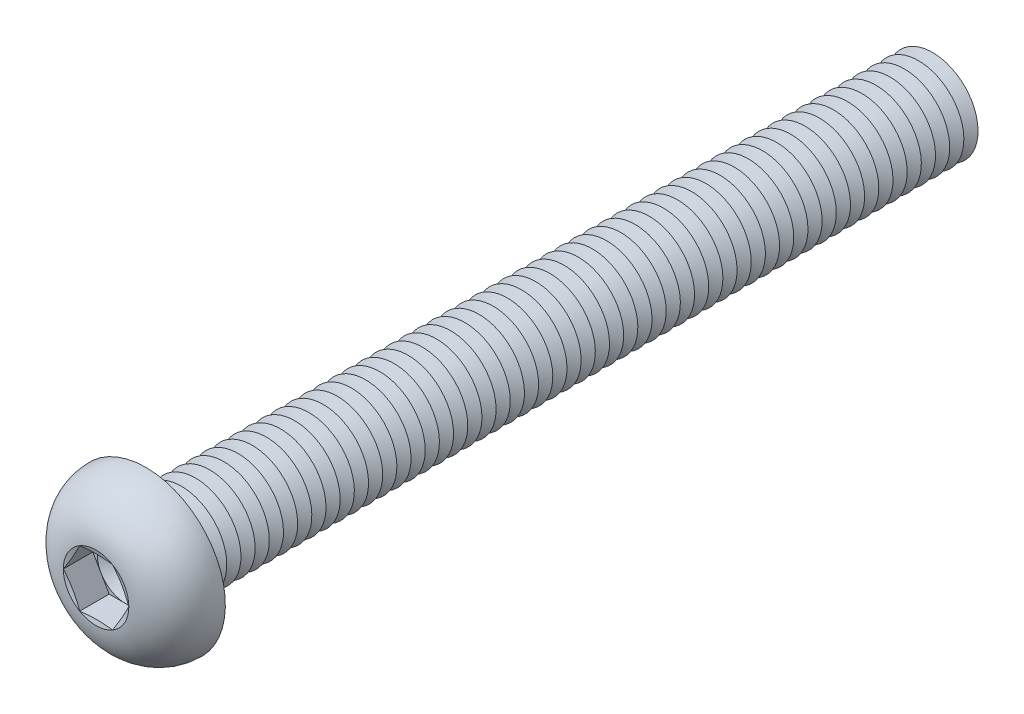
ISO-10303-21;
HEADER;
FILE_DESCRIPTION(('STEP AP214'),'2;1');
FILE_NAME('part.step','',(''),(''),'','','');
FILE_SCHEMA(('AUTOMOTIVE_DESIGN { 1 0 10303 214 1 1 1 1 }'));
ENDSEC;
DATA;
#1=APPLICATION_CONTEXT('core data for automotive mechanical design processes');
#2=APPLICATION_PROTOCOL_DEFINITION('international standard','automotive_design',2000,#1);
#3=PRODUCT_CONTEXT('',#1,'mechanical');
#4=PRODUCT('Part','Part','',(#3));
#5=PRODUCT_RELATED_PRODUCT_CATEGORY('part','',(#4));
#6=PRODUCT_DEFINITION_FORMATION('','',#4);
#7=PRODUCT_DEFINITION_CONTEXT('part definition',#1,'design');
#8=PRODUCT_DEFINITION('design','',#6,#7);
#9=PRODUCT_DEFINITION_SHAPE('','',#8);
#10=(LENGTH_UNIT() NAMED_UNIT(*) SI_UNIT(.MILLI.,.METRE.));
#11=(NAMED_UNIT(*) PLANE_ANGLE_UNIT() SI_UNIT($,.RADIAN.));
#12=(NAMED_UNIT(*) SI_UNIT($,.STERADIAN.) SOLID_ANGLE_UNIT());
#13=UNCERTAINTY_MEASURE_WITH_UNIT(LENGTH_MEASURE(1.E-05),#10,'distance_accuracy_value','');
#14=(GEOMETRIC_REPRESENTATION_CONTEXT(3) GLOBAL_UNCERTAINTY_ASSIGNED_CONTEXT((#13)) GLOBAL_UNIT_ASSIGNED_CONTEXT((#10,
#11,#12)) REPRESENTATION_CONTEXT('',''));
#15=CARTESIAN_POINT('',(0.,0.,0.));
#16=DIRECTION('',(0.,0.,1.));
#17=DIRECTION('',(1.,0.,0.));
#18=AXIS2_PLACEMENT_3D('',#15,#16,#17);
#19=CARTESIAN_POINT('',(0.,0.,1.8));
#20=DIRECTION('',(0.,0.,1.));
#21=DIRECTION('',(1.,0.,0.));
#22=AXIS2_PLACEMENT_3D('',#19,#20,#21);
#23=PLANE('',#22);
#24=CARTESIAN_POINT('',(0.,0.,1.8));
#25=DIRECTION('',(0.,0.,1.));
#26=DIRECTION('',(1.,0.,0.));
#27=AXIS2_PLACEMENT_3D('',#24,#25,#26);
#28=CIRCLE('',#27,2.49999883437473);
#29=CARTESIAN_POINT('',(2.1650625,1.24999941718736,1.8));
#30=VERTEX_POINT('',#29);
#31=CARTESIAN_POINT('',(0.,2.49999883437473,1.8));
#32=VERTEX_POINT('',#31);
#33=EDGE_CURVE('E118',#30,#32,#28,.T.);
#34=ORIENTED_EDGE('',*,*,#33,.F.);
#35=DIRECTION('',(-0.5,0.866025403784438,0.));
#36=VECTOR('',#35,1.);
#37=CARTESIAN_POINT('',(2.88675,0.,1.8));
#38=LINE('',#37,#36);
#39=CARTESIAN_POINT('',(1.443375,2.49999883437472,1.8));
#40=VERTEX_POINT('',#39);
#41=EDGE_CURVE('E125',#30,#40,#38,.T.);
#42=ORIENTED_EDGE('',*,*,#41,.T.);
#43=DIRECTION('',(-1.,0.,0.));
#44=VECTOR('',#43,1.);
#45=CARTESIAN_POINT('',(1.443375,2.49999883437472,1.8));
#46=LINE('',#45,#44);
#47=EDGE_CURVE('E136',#40,#32,#46,.T.);
#48=ORIENTED_EDGE('',*,*,#47,.T.);
#49=EDGE_LOOP('',(#34,#42,#48));
#50=FACE_BOUND('',#49,.T.);
#51=ADVANCED_FACE('F39',(#50),#23,.T.);
#52=CARTESIAN_POINT('',(0.,0.,1.8));
#53=DIRECTION('',(0.,0.,1.));
#54=DIRECTION('',(1.,0.,0.));
#55=AXIS2_PLACEMENT_3D('',#52,#53,#54);
#56=CIRCLE('',#55,2.49999883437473);
#57=CARTESIAN_POINT('',(-2.1650625,1.24999941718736,1.8));
#58=VERTEX_POINT('',#57);
#59=EDGE_CURVE('E11',#32,#58,#56,.T.);
#60=ORIENTED_EDGE('',*,*,#59,.F.);
#61=CARTESIAN_POINT('',(-1.443375,2.49999883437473,1.8));
#62=VERTEX_POINT('',#61);
#63=EDGE_CURVE('E131',#32,#62,#46,.T.);
#64=ORIENTED_EDGE('',*,*,#63,.T.);
#65=DIRECTION('',(-0.5,-0.866025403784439,0.));
#66=VECTOR('',#65,1.);
#67=CARTESIAN_POINT('',(-1.443375,2.49999883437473,1.8));
#68=LINE('',#67,#66);
#69=EDGE_CURVE('E134',#62,#58,#68,.T.);
#70=ORIENTED_EDGE('',*,*,#69,.T.);
#71=EDGE_LOOP('',(#60,#64,#70));
#72=FACE_BOUND('',#71,.T.);
#73=ADVANCED_FACE('F130',(#72),#23,.T.);
#74=CARTESIAN_POINT('',(-2.1650625,-1.24999941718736,1.8));
#75=VERTEX_POINT('',#74);
#76=EDGE_CURVE('E49',#58,#75,#56,.T.);
#77=ORIENTED_EDGE('',*,*,#76,.F.);
#78=CARTESIAN_POINT('',(-2.88675,0.,1.8));
#79=VERTEX_POINT('',#78);
#80=EDGE_CURVE('E143',#58,#79,#68,.T.);
#81=ORIENTED_EDGE('',*,*,#80,.T.);
#82=DIRECTION('',(0.5,-0.866025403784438,0.));
#83=VECTOR('',#82,1.);
#84=CARTESIAN_POINT('',(-2.88675,0.,1.8));
#85=LINE('',#84,#83);
#86=EDGE_CURVE('E152',#79,#75,#85,.T.);
#87=ORIENTED_EDGE('',*,*,#86,.T.);
#88=EDGE_LOOP('',(#77,#81,#87));
#89=FACE_BOUND('',#88,.T.);
#90=ADVANCED_FACE('F715',(#89),#23,.T.);
#91=CARTESIAN_POINT('',(0.,-2.49999883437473,1.8));
#92=VERTEX_POINT('',#91);
#93=EDGE_CURVE('E699',#75,#92,#56,.T.);
#94=ORIENTED_EDGE('',*,*,#93,.F.);
#95=CARTESIAN_POINT('',(-1.443375,-2.49999883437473,1.8));
#96=VERTEX_POINT('',#95);
#97=EDGE_CURVE('E151',#75,#96,#85,.T.);
#98=ORIENTED_EDGE('',*,*,#97,.T.);
#99=DIRECTION('',(1.,0.,0.));
#100=VECTOR('',#99,1.);
#101=CARTESIAN_POINT('',(-1.443375,-2.49999883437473,1.8));
#102=LINE('',#101,#100);
#103=EDGE_CURVE('E157',#96,#92,#102,.T.);
#104=ORIENTED_EDGE('',*,*,#103,.T.);
#105=EDGE_LOOP('',(#94,#98,#104));
#106=FACE_BOUND('',#105,.T.);
#107=ADVANCED_FACE('F708',(#106),#23,.T.);
#108=CARTESIAN_POINT('',(2.1650625,-1.24999941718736,1.8));
#109=VERTEX_POINT('',#108);
#110=EDGE_CURVE('E56',#92,#109,#56,.T.);
#111=ORIENTED_EDGE('',*,*,#110,.F.);
#112=CARTESIAN_POINT('',(1.443375,-2.49999883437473,1.8));
#113=VERTEX_POINT('',#112);
#114=EDGE_CURVE('E156',#92,#113,#102,.T.);
#115=ORIENTED_EDGE('',*,*,#114,.T.);
#116=DIRECTION('',(0.5,0.866025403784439,0.));
#117=VECTOR('',#116,1.);
#118=CARTESIAN_POINT('',(1.443375,-2.49999883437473,1.8));
#119=LINE('',#118,#117);
#120=EDGE_CURVE('E162',#113,#109,#119,.T.);
#121=ORIENTED_EDGE('',*,*,#120,.T.);
#122=EDGE_LOOP('',(#111,#115,#121));
#123=FACE_BOUND('',#122,.T.);
#124=ADVANCED_FACE('F785',(#123),#23,.T.);
#125=CARTESIAN_POINT('',(0.,0.,4.4));
#126=DIRECTION('',(0.,0.,1.));
#127=DIRECTION('',(0.,-1.,0.));
#128=AXIS2_PLACEMENT_3D('',#125,#126,#127);
#129=CONICAL_SURFACE('',#128,2.88675,1.30899693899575);
#130=CARTESIAN_POINT('',(2.88686547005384,-0.000200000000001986,4.40003094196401));
#131=CARTESIAN_POINT('',(2.82691617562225,0.103635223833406,4.3839595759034));
#132=CARTESIAN_POINT('',(2.76685817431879,0.20765873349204,4.36936933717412));
#133=CARTESIAN_POINT('',(2.64653003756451,0.416073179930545,4.3437355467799));
#134=CARTESIAN_POINT('',(2.58625982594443,0.520464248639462,4.33269343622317));
#135=CARTESIAN_POINT('',(2.46587274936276,0.72898078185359,4.31480063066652));
#136=CARTESIAN_POINT('',(2.40575669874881,0.833104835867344,4.3079285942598));
#137=CARTESIAN_POINT('',(2.28544792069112,1.04148575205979,4.29871388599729));
#138=CARTESIAN_POINT('',(2.22525521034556,1.14574258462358,4.29637033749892));
#139=CARTESIAN_POINT('',(2.10486978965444,1.35425624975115,4.29637033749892));
#140=CARTESIAN_POINT('',(2.04467707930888,1.45851308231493,4.29871388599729));
#141=CARTESIAN_POINT('',(1.92436830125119,1.66689399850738,4.3079285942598));
#142=CARTESIAN_POINT('',(1.86425225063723,1.77101805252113,4.31480063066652));
#143=CARTESIAN_POINT('',(1.74386517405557,1.97953458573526,4.33269343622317));
#144=CARTESIAN_POINT('',(1.68359496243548,2.08392565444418,4.3437355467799));
#145=CARTESIAN_POINT('',(1.56326682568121,2.29234010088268,4.36936933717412));
#146=CARTESIAN_POINT('',(1.50320882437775,2.39636361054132,4.3839595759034));
#147=CARTESIAN_POINT('',(1.44325952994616,2.50019883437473,4.40003094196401));
#148=B_SPLINE_CURVE_WITH_KNOTS('',3,(#130,#131,#132,#133,#134,#135,#136,#137,#138,#139,#140,
#141,#142,#143,#144,#145,#146,#147),.UNSPECIFIED.,.F.,.F.,(4,2,2,2,2,2,2,2,4),(0.,
0.362931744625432,0.726010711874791,1.08721550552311,1.44835036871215,1.80948523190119,
2.17069002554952,2.53376899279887,2.89670073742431),.UNSPECIFIED.);
#149=CARTESIAN_POINT('',(2.88675,0.,4.4));
#150=VERTEX_POINT('',#149);
#151=CARTESIAN_POINT('',(1.443375,2.49999883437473,4.4));
#152=VERTEX_POINT('',#151);
#153=EDGE_CURVE('E221',#150,#152,#148,.T.);
#154=ORIENTED_EDGE('',*,*,#153,.F.);
#155=CARTESIAN_POINT('',(0.,0.,4.4));
#156=DIRECTION('',(0.,0.,-1.));
#157=DIRECTION('',(0.,1.,0.));
#158=AXIS2_PLACEMENT_3D('',#155,#156,#157);
#159=CIRCLE('',#158,2.88675);
#160=EDGE_CURVE('E684',#152,#150,#159,.T.);
#161=ORIENTED_EDGE('',*,*,#160,.F.);
#162=EDGE_LOOP('',(#154,#161));
#163=FACE_BOUND('',#162,.T.);
#164=ADVANCED_FACE('F789',(#163),#129,.F.);
#165=CARTESIAN_POINT('',(1.44325952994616,-2.50019883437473,4.40003094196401));
#166=CARTESIAN_POINT('',(1.50320882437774,-2.39636361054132,4.3839595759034));
#167=CARTESIAN_POINT('',(1.56326682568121,-2.29234010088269,4.36936933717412));
#168=CARTESIAN_POINT('',(1.68359496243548,-2.08392565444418,4.3437355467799));
#169=CARTESIAN_POINT('',(1.74386517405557,-1.97953458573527,4.33269343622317));
#170=CARTESIAN_POINT('',(1.86425225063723,-1.77101805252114,4.31480063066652));
#171=CARTESIAN_POINT('',(1.92436830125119,-1.66689399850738,4.3079285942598));
#172=CARTESIAN_POINT('',(2.04467707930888,-1.45851308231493,4.29871388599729));
#173=CARTESIAN_POINT('',(2.10486978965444,-1.35425624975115,4.29637033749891));
#174=CARTESIAN_POINT('',(2.22525521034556,-1.14574258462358,4.29637033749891));
#175=CARTESIAN_POINT('',(2.28544792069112,-1.0414857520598,4.29871388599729));
#176=CARTESIAN_POINT('',(2.40575669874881,-0.833104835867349,4.3079285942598));
#177=CARTESIAN_POINT('',(2.46587274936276,-0.728980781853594,4.31480063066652));
#178=CARTESIAN_POINT('',(2.58625982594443,-0.520464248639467,4.33269343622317));
#179=CARTESIAN_POINT('',(2.64653003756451,-0.41607317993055,4.3437355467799));
#180=CARTESIAN_POINT('',(2.76685817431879,-0.207658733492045,4.36936933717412));
#181=CARTESIAN_POINT('',(2.82691617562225,-0.103635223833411,4.3839595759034));
#182=CARTESIAN_POINT('',(2.88686547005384,0.000199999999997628,4.40003094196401));
#183=B_SPLINE_CURVE_WITH_KNOTS('',3,(#165,#166,#167,#168,#169,#170,#171,#172,#173,#174,#175,
#176,#177,#178,#179,#180,#181,#182),.UNSPECIFIED.,.F.,.F.,(4,2,2,2,2,2,2,2,4),(0.,
0.362931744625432,0.726010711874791,1.08721550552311,1.44835036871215,1.80948523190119,
2.17069002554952,2.53376899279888,2.89670073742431),.UNSPECIFIED.);
#184=CARTESIAN_POINT('',(1.443375,-2.49999883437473,4.4));
#185=VERTEX_POINT('',#184);
#186=EDGE_CURVE('E230',#185,#150,#183,.T.);
#187=ORIENTED_EDGE('',*,*,#186,.F.);
#188=EDGE_CURVE('E689',#150,#185,#159,.T.);
#189=ORIENTED_EDGE('',*,*,#188,.F.);
#190=EDGE_LOOP('',(#187,#189));
#191=FACE_BOUND('',#190,.T.);
#192=ADVANCED_FACE('F750',(#191),#129,.F.);
#193=CARTESIAN_POINT('',(-4.35611719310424,-2.49999883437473,4.97227902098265));
#194=CARTESIAN_POINT('',(-4.25066509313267,-2.49999883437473,4.94777440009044));
#195=CARTESIAN_POINT('',(-4.14516541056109,-2.49999883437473,4.92347459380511));
#196=CARTESIAN_POINT('',(-3.93405094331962,-2.49999883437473,4.87537247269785));
#197=CARTESIAN_POINT('',(-3.82843615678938,-2.49999883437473,4.85157016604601));
#198=CARTESIAN_POINT('',(-3.5113534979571,-2.49999883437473,4.78103338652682));
#199=CARTESIAN_POINT('',(-3.29968815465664,-2.49999883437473,4.73517861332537));
#200=CARTESIAN_POINT('',(-2.87365524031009,-2.49999883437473,4.6464558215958));
#201=CARTESIAN_POINT('',(-2.65928093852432,-2.49999883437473,4.60361983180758));
#202=CARTESIAN_POINT('',(-2.22952626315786,-2.49999883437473,4.52311285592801));
#203=CARTESIAN_POINT('',(-2.01414580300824,-2.49999883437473,4.48544232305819));
#204=CARTESIAN_POINT('',(-1.58798319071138,-2.49999883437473,4.41876559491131));
#205=CARTESIAN_POINT('',(-1.37723418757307,-2.49999883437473,4.38955265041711));
#206=CARTESIAN_POINT('',(-0.95453034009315,-2.49999883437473,4.34171384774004));
#207=CARTESIAN_POINT('',(-0.742575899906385,-2.49999883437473,4.32308463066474));
#208=CARTESIAN_POINT('',(-0.424544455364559,-2.49999883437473,4.3053914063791));
#209=CARTESIAN_POINT('',(-0.318745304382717,-2.49999883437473,4.30120018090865));
#210=CARTESIAN_POINT('',(-0.107062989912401,-2.49999883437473,4.29638997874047));
#211=CARTESIAN_POINT('',(-0.00117982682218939,-2.49999883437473,4.29577098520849));
#212=CARTESIAN_POINT('',(0.210552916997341,-2.49999883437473,4.29814378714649));
#213=CARTESIAN_POINT('',(0.316402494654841,-2.49999883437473,4.30113585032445));
#214=CARTESIAN_POINT('',(0.527944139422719,-2.49999883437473,4.31057322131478));
#215=CARTESIAN_POINT('',(0.63363620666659,-2.49999883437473,4.31701852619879));
#216=CARTESIAN_POINT('',(0.890304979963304,-2.49999883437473,4.33652018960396));
#217=CARTESIAN_POINT('',(1.0411561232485,-2.49999883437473,4.35122885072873));
#218=CARTESIAN_POINT('',(1.34222474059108,-2.49999883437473,4.38593609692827));
#219=CARTESIAN_POINT('',(1.49244223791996,-2.49999883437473,4.40593448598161));
#220=CARTESIAN_POINT('',(1.79273634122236,-2.49999883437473,4.45011321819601));
#221=CARTESIAN_POINT('',(1.94281100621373,-2.49999883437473,4.47430656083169));
#222=CARTESIAN_POINT('',(2.24242097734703,-2.49999883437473,4.52583552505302));
#223=CARTESIAN_POINT('',(2.39195625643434,-2.49999883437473,4.55317130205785));
#224=CARTESIAN_POINT('',(2.69364402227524,-2.49999883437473,4.61079781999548));
#225=CARTESIAN_POINT('',(2.8457870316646,-2.49999883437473,4.64113779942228));
#226=CARTESIAN_POINT('',(3.14969016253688,-2.49999883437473,4.70367638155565));
#227=CARTESIAN_POINT('',(3.30145027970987,-2.49999883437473,4.73587500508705));
#228=CARTESIAN_POINT('',(3.60383766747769,-2.49999883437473,4.80150275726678));
#229=CARTESIAN_POINT('',(3.75446660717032,-2.49999883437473,4.83492423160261));
#230=CARTESIAN_POINT('',(4.05546753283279,-2.49999883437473,4.90285814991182));
#231=CARTESIAN_POINT('',(4.2058395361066,-2.49999883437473,4.93737051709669));
#232=CARTESIAN_POINT('',(4.35611719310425,-2.49999883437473,4.97227902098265));
#233=B_SPLINE_CURVE_WITH_KNOTS('',3,(#193,#194,#195,#196,#197,#198,#199,#200,#201,#202,#203,
#204,#205,#206,#207,#208,#209,#210,#211,#212,#213,#214,#215,#216,#217,#218,#219,#220,#221,#222,
#223,#224,#225,#226,#227,#228,#229,#230,#231,#232),.UNSPECIFIED.,.F.,.F.,(4,2,2,2,2,2,2,2,2,2,2,
2,2,2,2,2,2,2,2,4),(0.,0.324785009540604,0.649575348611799,1.29928181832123,1.95507889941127,
2.61093348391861,3.24905289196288,3.88696967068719,4.204563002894,4.5221548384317,
4.83977022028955,5.15738533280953,5.61196030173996,6.06651842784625,6.52251118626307,
6.97852650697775,7.44392737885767,7.90933346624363,8.37220553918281,8.83504510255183),.UNSPECIFIED.);
#234=CARTESIAN_POINT('',(-1.443375,-2.49999883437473,4.4));
#235=VERTEX_POINT('',#234);
#236=EDGE_CURVE('E729',#235,#185,#233,.T.);
#237=ORIENTED_EDGE('',*,*,#236,.F.);
#238=EDGE_CURVE('E742',#185,#235,#159,.T.);
#239=ORIENTED_EDGE('',*,*,#238,.F.);
#240=EDGE_LOOP('',(#237,#239));
#241=FACE_BOUND('',#240,.T.);
#242=ADVANCED_FACE('F756',(#241),#129,.F.);
#243=CARTESIAN_POINT('',(-2.88686547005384,0.000199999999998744,4.40003094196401));
#244=CARTESIAN_POINT('',(-2.82691617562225,-0.10363522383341,4.3839595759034));
#245=CARTESIAN_POINT('',(-2.76685817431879,-0.207658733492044,4.36936933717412));
#246=CARTESIAN_POINT('',(-2.64653003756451,-0.416073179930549,4.3437355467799));
#247=CARTESIAN_POINT('',(-2.58625982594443,-0.520464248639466,4.33269343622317));
#248=CARTESIAN_POINT('',(-2.46587274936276,-0.728980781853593,4.31480063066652));
#249=CARTESIAN_POINT('',(-2.40575669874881,-0.833104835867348,4.3079285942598));
#250=CARTESIAN_POINT('',(-2.28544792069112,-1.0414857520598,4.29871388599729));
#251=CARTESIAN_POINT('',(-2.22525521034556,-1.14574258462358,4.29637033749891));
#252=CARTESIAN_POINT('',(-2.10486978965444,-1.35425624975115,4.29637033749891));
#253=CARTESIAN_POINT('',(-2.04467707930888,-1.45851308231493,4.29871388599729));
#254=CARTESIAN_POINT('',(-1.92436830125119,-1.66689399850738,4.3079285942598));
#255=CARTESIAN_POINT('',(-1.86425225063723,-1.77101805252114,4.31480063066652));
#256=CARTESIAN_POINT('',(-1.74386517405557,-1.97953458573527,4.33269343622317));
#257=CARTESIAN_POINT('',(-1.68359496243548,-2.08392565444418,4.3437355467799));
#258=CARTESIAN_POINT('',(-1.56326682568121,-2.29234010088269,4.36936933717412));
#259=CARTESIAN_POINT('',(-1.50320882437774,-2.39636361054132,4.3839595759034));
#260=CARTESIAN_POINT('',(-1.44325952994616,-2.50019883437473,4.40003094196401));
#261=B_SPLINE_CURVE_WITH_KNOTS('',3,(#243,#244,#245,#246,#247,#248,#249,#250,#251,#252,#253,
#254,#255,#256,#257,#258,#259,#260),.UNSPECIFIED.,.F.,.F.,(4,2,2,2,2,2,2,2,4),(0.,
0.362931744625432,0.726010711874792,1.08721550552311,1.44835036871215,1.8094852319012,
2.17069002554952,2.53376899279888,2.89670073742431),.UNSPECIFIED.);
#262=CARTESIAN_POINT('',(-2.88675,0.,4.4));
#263=VERTEX_POINT('',#262);
#264=EDGE_CURVE('E720',#263,#235,#261,.T.);
#265=ORIENTED_EDGE('',*,*,#264,.F.);
#266=EDGE_CURVE('E726',#235,#263,#159,.T.);
#267=ORIENTED_EDGE('',*,*,#266,.F.);
#268=EDGE_LOOP('',(#265,#267));
#269=FACE_BOUND('',#268,.T.);
#270=ADVANCED_FACE('F724',(#269),#129,.F.);
#271=CARTESIAN_POINT('',(-1.44325952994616,2.50019883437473,4.40003094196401));
#272=CARTESIAN_POINT('',(-1.50320882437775,2.39636361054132,4.3839595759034));
#273=CARTESIAN_POINT('',(-1.56326682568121,2.29234010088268,4.36936933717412));
#274=CARTESIAN_POINT('',(-1.68359496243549,2.08392565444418,4.3437355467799));
#275=CARTESIAN_POINT('',(-1.74386517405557,1.97953458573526,4.33269343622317));
#276=CARTESIAN_POINT('',(-1.86425225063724,1.77101805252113,4.31480063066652));
#277=CARTESIAN_POINT('',(-1.92436830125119,1.66689399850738,4.3079285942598));
#278=CARTESIAN_POINT('',(-2.04467707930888,1.45851308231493,4.29871388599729));
#279=CARTESIAN_POINT('',(-2.10486978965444,1.35425624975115,4.29637033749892));
#280=CARTESIAN_POINT('',(-2.22525521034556,1.14574258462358,4.29637033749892));
#281=CARTESIAN_POINT('',(-2.28544792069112,1.04148575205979,4.29871388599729));
#282=CARTESIAN_POINT('',(-2.40575669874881,0.833104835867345,4.3079285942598));
#283=CARTESIAN_POINT('',(-2.46587274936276,0.72898078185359,4.31480063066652));
#284=CARTESIAN_POINT('',(-2.58625982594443,0.520464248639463,4.33269343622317));
#285=CARTESIAN_POINT('',(-2.64653003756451,0.416073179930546,4.3437355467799));
#286=CARTESIAN_POINT('',(-2.76685817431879,0.20765873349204,4.36936933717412));
#287=CARTESIAN_POINT('',(-2.82691617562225,0.103635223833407,4.3839595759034));
#288=CARTESIAN_POINT('',(-2.88686547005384,-0.000200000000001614,4.40003094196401));
#289=B_SPLINE_CURVE_WITH_KNOTS('',3,(#271,#272,#273,#274,#275,#276,#277,#278,#279,#280,#281,
#282,#283,#284,#285,#286,#287,#288),.UNSPECIFIED.,.F.,.F.,(4,2,2,2,2,2,2,2,4),(0.,
0.362931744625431,0.726010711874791,1.08721550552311,1.44835036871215,1.80948523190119,
2.17069002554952,2.53376899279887,2.89670073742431),.UNSPECIFIED.);
#290=CARTESIAN_POINT('',(-1.443375,2.49999883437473,4.4));
#291=VERTEX_POINT('',#290);
#292=EDGE_CURVE('E195',#291,#263,#289,.T.);
#293=ORIENTED_EDGE('',*,*,#292,.F.);
#294=EDGE_CURVE('E732',#263,#291,#159,.T.);
#295=ORIENTED_EDGE('',*,*,#294,.F.);
#296=EDGE_LOOP('',(#293,#295));
#297=FACE_BOUND('',#296,.T.);
#298=ADVANCED_FACE('F733',(#297),#129,.F.);
#299=CARTESIAN_POINT('',(0.,0.,-65.625));
#300=DIRECTION('',(0.,0.,1.));
#301=DIRECTION('',(0.,-1.,0.));
#302=AXIS2_PLACEMENT_3D('',#299,#300,#301);
#303=CONICAL_SURFACE('',#302,3.99999999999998,1.0471975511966);
#304=CARTESIAN_POINT('',(0.,0.,-66.25));
#305=DIRECTION('',(0.,0.,1.));
#306=DIRECTION('',(0.,-1.,0.));
#307=AXIS2_PLACEMENT_3D('',#304,#305,#306);
#308=CIRCLE('',#307,2.91746824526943);
#309=CARTESIAN_POINT('',(0.,-2.91746824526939,-66.25));
#310=VERTEX_POINT('',#309);
#311=EDGE_CURVE('E655',#310,#310,#308,.T.);
#312=ORIENTED_EDGE('',*,*,#311,.T.);
#313=EDGE_LOOP('',(#312));
#314=FACE_BOUND('',#313,.T.);
#315=CARTESIAN_POINT('',(0.,0.,-65.625));
#316=DIRECTION('',(0.,0.,1.));
#317=DIRECTION('',(0.,-1.,0.));
#318=AXIS2_PLACEMENT_3D('',#315,#316,#317);
#319=CIRCLE('',#318,3.99999999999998);
#320=CARTESIAN_POINT('',(0.,-3.99999999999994,-65.625));
#321=VERTEX_POINT('',#320);
#322=EDGE_CURVE('E651',#321,#321,#319,.T.);
#323=ORIENTED_EDGE('',*,*,#322,.F.);
#324=EDGE_LOOP('',(#323));
#325=FACE_BOUND('',#324,.T.);
#326=ADVANCED_FACE('F817',(#314,#325),#303,.T.);
#327=CARTESIAN_POINT('',(0.,0.,-66.25));
#328=DIRECTION('',(0.,0.,-1.));
#329=DIRECTION('',(0.,1.,0.));
#330=AXIS2_PLACEMENT_3D('',#327,#328,#329);
#331=CONICAL_SURFACE('',#330,2.91746824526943,1.0471975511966);
#332=CARTESIAN_POINT('',(0.,0.,-66.875));
#333=DIRECTION('',(0.,0.,1.));
#334=DIRECTION('',(0.,-1.,0.));
#335=AXIS2_PLACEMENT_3D('',#332,#333,#334);
#336=CIRCLE('',#335,3.99999999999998);
#337=CARTESIAN_POINT('',(0.,-3.99999999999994,-66.875));
#338=VERTEX_POINT('',#337);
#339=EDGE_CURVE('E659',#338,#338,#336,.T.);
#340=ORIENTED_EDGE('',*,*,#339,.T.);
#341=EDGE_LOOP('',(#340));
#342=FACE_BOUND('',#341,.T.);
#343=ORIENTED_EDGE('',*,*,#311,.F.);
#344=EDGE_LOOP('',(#343));
#345=FACE_BOUND('',#344,.T.);
#346=ADVANCED_FACE('F822',(#342,#345),#331,.T.);
#347=CARTESIAN_POINT('',(0.,3.99999999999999,-70.));
#348=DIRECTION('',(0.,0.,-1.));
#349=DIRECTION('',(0.,1.,0.));
#350=AXIS2_PLACEMENT_3D('',#347,#348,#349);
#351=PLANE('',#350);
#352=CARTESIAN_POINT('',(0.,0.,-70.));
#353=DIRECTION('',(0.,0.,1.));
#354=DIRECTION('',(0.,-1.,0.));
#355=AXIS2_PLACEMENT_3D('',#352,#353,#354);
#356=CIRCLE('',#355,2.91746824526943);
#357=CARTESIAN_POINT('',(0.,-2.91746824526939,-70.));
#358=VERTEX_POINT('',#357);
#359=EDGE_CURVE('E679',#358,#358,#356,.T.);
#360=ORIENTED_EDGE('',*,*,#359,.F.);
#361=EDGE_LOOP('',(#360));
#362=FACE_BOUND('',#361,.T.);
#363=ADVANCED_FACE('F989',(#362),#351,.T.);
#364=CARTESIAN_POINT('',(0.,0.,-69.375));
#365=DIRECTION('',(0.,0.,1.));
#366=DIRECTION('',(0.,-1.,0.));
#367=AXIS2_PLACEMENT_3D('',#364,#365,#366);
#368=CONICAL_SURFACE('',#367,3.99999999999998,1.0471975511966);
#369=ORIENTED_EDGE('',*,*,#359,.T.);
#370=EDGE_LOOP('',(#369));
#371=FACE_BOUND('',#370,.T.);
#372=CARTESIAN_POINT('',(0.,0.,-69.375));
#373=DIRECTION('',(0.,0.,1.));
#374=DIRECTION('',(0.,-1.,0.));
#375=AXIS2_PLACEMENT_3D('',#372,#373,#374);
#376=CIRCLE('',#375,3.99999999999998);
#377=CARTESIAN_POINT('',(0.,-3.99999999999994,-69.375));
#378=VERTEX_POINT('',#377);
#379=EDGE_CURVE('E675',#378,#378,#376,.T.);
#380=ORIENTED_EDGE('',*,*,#379,.F.);
#381=EDGE_LOOP('',(#380));
#382=FACE_BOUND('',#381,.T.);
#383=ADVANCED_FACE('F982',(#371,#382),#368,.T.);
#384=CARTESIAN_POINT('',(0.,0.,-68.75));
#385=DIRECTION('',(0.,0.,-1.));
#386=DIRECTION('',(0.,1.,0.));
#387=AXIS2_PLACEMENT_3D('',#384,#385,#386);
#388=CONICAL_SURFACE('',#387,2.91746824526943,1.0471975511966);
#389=ORIENTED_EDGE('',*,*,#379,.T.);
#390=EDGE_LOOP('',(#389));
#391=FACE_BOUND('',#390,.T.);
#392=CARTESIAN_POINT('',(0.,0.,-68.75));
#393=DIRECTION('',(0.,0.,1.));
#394=DIRECTION('',(0.,-1.,0.));
#395=AXIS2_PLACEMENT_3D('',#392,#393,#394);
#396=CIRCLE('',#395,2.91746824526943);
#397=CARTESIAN_POINT('',(0.,-2.91746824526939,-68.75));
#398=VERTEX_POINT('',#397);
#399=EDGE_CURVE('E671',#398,#398,#396,.T.);
#400=ORIENTED_EDGE('',*,*,#399,.F.);
#401=EDGE_LOOP('',(#400));
#402=FACE_BOUND('',#401,.T.);
#403=ADVANCED_FACE('F988',(#391,#402),#388,.T.);
#404=CARTESIAN_POINT('',(0.,0.,-68.125));
#405=DIRECTION('',(0.,0.,1.));
#406=DIRECTION('',(0.,-1.,0.));
#407=AXIS2_PLACEMENT_3D('',#404,#405,#406);
#408=CONICAL_SURFACE('',#407,3.99999999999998,1.0471975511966);
#409=ORIENTED_EDGE('',*,*,#399,.T.);
#410=EDGE_LOOP('',(#409));
#411=FACE_BOUND('',#410,.T.);
#412=CARTESIAN_POINT('',(0.,0.,-68.125));
#413=DIRECTION('',(0.,0.,1.));
#414=DIRECTION('',(0.,-1.,0.));
#415=AXIS2_PLACEMENT_3D('',#412,#413,#414);
#416=CIRCLE('',#415,3.99999999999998);
#417=CARTESIAN_POINT('',(0.,-3.99999999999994,-68.125));
#418=VERTEX_POINT('',#417);
#419=EDGE_CURVE('E667',#418,#418,#416,.T.);
#420=ORIENTED_EDGE('',*,*,#419,.F.);
#421=EDGE_LOOP('',(#420));
#422=FACE_BOUND('',#421,.T.);
#423=ADVANCED_FACE('F1020',(#411,#422),#408,.T.);
#424=CARTESIAN_POINT('',(0.,0.,-67.5));
#425=DIRECTION('',(0.,0.,-1.));
#426=DIRECTION('',(0.,1.,0.));
#427=AXIS2_PLACEMENT_3D('',#424,#425,#426);
#428=CONICAL_SURFACE('',#427,2.91746824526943,1.0471975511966);
#429=ORIENTED_EDGE('',*,*,#419,.T.);
#430=EDGE_LOOP('',(#429));
#431=FACE_BOUND('',#430,.T.);
#432=CARTESIAN_POINT('',(0.,0.,-67.5));
#433=DIRECTION('',(0.,0.,1.));
#434=DIRECTION('',(0.,-1.,0.));
#435=AXIS2_PLACEMENT_3D('',#432,#433,#434);
#436=CIRCLE('',#435,2.91746824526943);
#437=CARTESIAN_POINT('',(0.,-2.91746824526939,-67.5));
#438=VERTEX_POINT('',#437);
#439=EDGE_CURVE('E663',#438,#438,#436,.T.);
#440=ORIENTED_EDGE('',*,*,#439,.F.);
#441=EDGE_LOOP('',(#440));
#442=FACE_BOUND('',#441,.T.);
#443=ADVANCED_FACE('F1030',(#431,#442),#428,.T.);
#444=CARTESIAN_POINT('',(0.,0.,-66.875));
#445=DIRECTION('',(0.,0.,1.));
#446=DIRECTION('',(0.,-1.,0.));
#447=AXIS2_PLACEMENT_3D('',#444,#445,#446);
#448=CONICAL_SURFACE('',#447,3.99999999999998,1.0471975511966);
#449=ORIENTED_EDGE('',*,*,#439,.T.);
#450=EDGE_LOOP('',(#449));
#451=FACE_BOUND('',#450,.T.);
#452=ORIENTED_EDGE('',*,*,#339,.F.);
#453=EDGE_LOOP('',(#452));
#454=FACE_BOUND('',#453,.T.);
#455=ADVANCED_FACE('F1040',(#451,#454),#448,.T.);
#456=CARTESIAN_POINT('',(0.,0.,-64.375));
#457=DIRECTION('',(0.,0.,1.));
#458=DIRECTION('',(0.,-1.,0.));
#459=AXIS2_PLACEMENT_3D('',#456,#457,#458);
#460=CONICAL_SURFACE('',#459,3.99999999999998,1.0471975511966);
#461=CARTESIAN_POINT('',(0.,0.,-65.));
#462=DIRECTION('',(0.,0.,1.));
#463=DIRECTION('',(0.,-1.,0.));
#464=AXIS2_PLACEMENT_3D('',#461,#462,#463);
#465=CIRCLE('',#464,2.91746824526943);
#466=CARTESIAN_POINT('',(0.,-2.91746824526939,-65.));
#467=VERTEX_POINT('',#466);
#468=EDGE_CURVE('E647',#467,#467,#465,.T.);
#469=ORIENTED_EDGE('',*,*,#468,.T.);
#470=EDGE_LOOP('',(#469));
#471=FACE_BOUND('',#470,.T.);
#472=CARTESIAN_POINT('',(0.,0.,-64.375));
#473=DIRECTION('',(0.,0.,1.));
#474=DIRECTION('',(0.,-1.,0.));
#475=AXIS2_PLACEMENT_3D('',#472,#473,#474);
#476=CIRCLE('',#475,3.99999999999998);
#477=CARTESIAN_POINT('',(0.,-3.99999999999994,-64.375));
#478=VERTEX_POINT('',#477);
#479=EDGE_CURVE('E643',#478,#478,#476,.T.);
#480=ORIENTED_EDGE('',*,*,#479,.F.);
#481=EDGE_LOOP('',(#480));
#482=FACE_BOUND('',#481,.T.);
#483=ADVANCED_FACE('F1050',(#471,#482),#460,.T.);
#484=CARTESIAN_POINT('',(0.,0.,-65.));
#485=DIRECTION('',(0.,0.,-1.));
#486=DIRECTION('',(0.,1.,0.));
#487=AXIS2_PLACEMENT_3D('',#484,#485,#486);
#488=CONICAL_SURFACE('',#487,2.91746824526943,1.0471975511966);
#489=ORIENTED_EDGE('',*,*,#322,.T.);
#490=EDGE_LOOP('',(#489));
#491=FACE_BOUND('',#490,.T.);
#492=ORIENTED_EDGE('',*,*,#468,.F.);
#493=EDGE_LOOP('',(#492));
#494=FACE_BOUND('',#493,.T.);
#495=ADVANCED_FACE('F1060',(#491,#494),#488,.T.);
#496=CARTESIAN_POINT('',(0.,0.,-63.125));
#497=DIRECTION('',(0.,0.,1.));
#498=DIRECTION('',(0.,-1.,0.));
#499=AXIS2_PLACEMENT_3D('',#496,#497,#498);
#500=CONICAL_SURFACE('',#499,3.99999999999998,1.0471975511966);
#501=CARTESIAN_POINT('',(0.,0.,-63.75));
#502=DIRECTION('',(0.,0.,1.));
#503=DIRECTION('',(0.,-1.,0.));
#504=AXIS2_PLACEMENT_3D('',#501,#502,#503);
#505=CIRCLE('',#504,2.91746824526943);
#506=CARTESIAN_POINT('',(0.,-2.9174682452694,-63.75));
#507=VERTEX_POINT('',#506);
#508=EDGE_CURVE('E639',#507,#507,#505,.T.);
#509=ORIENTED_EDGE('',*,*,#508,.T.);
#510=EDGE_LOOP('',(#509));
#511=FACE_BOUND('',#510,.T.);
#512=CARTESIAN_POINT('',(0.,0.,-63.125));
#513=DIRECTION('',(0.,0.,1.));
#514=DIRECTION('',(0.,-1.,0.));
#515=AXIS2_PLACEMENT_3D('',#512,#513,#514);
#516=CIRCLE('',#515,3.99999999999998);
#517=CARTESIAN_POINT('',(0.,-3.99999999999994,-63.125));
#518=VERTEX_POINT('',#517);
#519=EDGE_CURVE('E635',#518,#518,#516,.T.);
#520=ORIENTED_EDGE('',*,*,#519,.F.);
#521=EDGE_LOOP('',(#520));
#522=FACE_BOUND('',#521,.T.);
#523=ADVANCED_FACE('F1070',(#511,#522),#500,.T.);
#524=CARTESIAN_POINT('',(0.,0.,-63.75));
#525=DIRECTION('',(0.,0.,-1.));
#526=DIRECTION('',(0.,1.,0.));
#527=AXIS2_PLACEMENT_3D('',#524,#525,#526);
#528=CONICAL_SURFACE('',#527,2.91746824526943,1.0471975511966);
#529=ORIENTED_EDGE('',*,*,#479,.T.);
#530=EDGE_LOOP('',(#529));
#531=FACE_BOUND('',#530,.T.);
#532=ORIENTED_EDGE('',*,*,#508,.F.);
#533=EDGE_LOOP('',(#532));
#534=FACE_BOUND('',#533,.T.);
#535=ADVANCED_FACE('F1080',(#531,#534),#528,.T.);
#536=CARTESIAN_POINT('',(0.,0.,-61.875));
#537=DIRECTION('',(0.,0.,1.));
#538=DIRECTION('',(0.,-1.,0.));
#539=AXIS2_PLACEMENT_3D('',#536,#537,#538);
#540=CONICAL_SURFACE('',#539,3.99999999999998,1.0471975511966);
#541=CARTESIAN_POINT('',(0.,0.,-62.5));
#542=DIRECTION('',(0.,0.,1.));
#543=DIRECTION('',(0.,-1.,0.));
#544=AXIS2_PLACEMENT_3D('',#541,#542,#543);
#545=CIRCLE('',#544,2.91746824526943);
#546=CARTESIAN_POINT('',(0.,-2.9174682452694,-62.5));
#547=VERTEX_POINT('',#546);
#548=EDGE_CURVE('E631',#547,#547,#545,.T.);
#549=ORIENTED_EDGE('',*,*,#548,.T.);
#550=EDGE_LOOP('',(#549));
#551=FACE_BOUND('',#550,.T.);
#552=CARTESIAN_POINT('',(0.,0.,-61.875));
#553=DIRECTION('',(0.,0.,1.));
#554=DIRECTION('',(0.,-1.,0.));
#555=AXIS2_PLACEMENT_3D('',#552,#553,#554);
#556=CIRCLE('',#555,3.99999999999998);
#557=CARTESIAN_POINT('',(0.,-3.99999999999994,-61.875));
#558=VERTEX_POINT('',#557);
#559=EDGE_CURVE('E627',#558,#558,#556,.T.);
#560=ORIENTED_EDGE('',*,*,#559,.F.);
#561=EDGE_LOOP('',(#560));
#562=FACE_BOUND('',#561,.T.);
#563=ADVANCED_FACE('F1090',(#551,#562),#540,.T.);
#564=CARTESIAN_POINT('',(0.,0.,-62.5));
#565=DIRECTION('',(0.,0.,-1.));
#566=DIRECTION('',(0.,1.,0.));
#567=AXIS2_PLACEMENT_3D('',#564,#565,#566);
#568=CONICAL_SURFACE('',#567,2.91746824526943,1.0471975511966);
#569=ORIENTED_EDGE('',*,*,#519,.T.);
#570=EDGE_LOOP('',(#569));
#571=FACE_BOUND('',#570,.T.);
#572=ORIENTED_EDGE('',*,*,#548,.F.);
#573=EDGE_LOOP('',(#572));
#574=FACE_BOUND('',#573,.T.);
#575=ADVANCED_FACE('F1100',(#571,#574),#568,.T.);
#576=CARTESIAN_POINT('',(0.,0.,-60.625));
#577=DIRECTION('',(0.,0.,1.));
#578=DIRECTION('',(0.,-1.,0.));
#579=AXIS2_PLACEMENT_3D('',#576,#577,#578);
#580=CONICAL_SURFACE('',#579,3.99999999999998,1.0471975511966);
#581=CARTESIAN_POINT('',(0.,0.,-61.25));
#582=DIRECTION('',(0.,0.,1.));
#583=DIRECTION('',(0.,-1.,0.));
#584=AXIS2_PLACEMENT_3D('',#581,#582,#583);
#585=CIRCLE('',#584,2.91746824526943);
#586=CARTESIAN_POINT('',(0.,-2.9174682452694,-61.25));
#587=VERTEX_POINT('',#586);
#588=EDGE_CURVE('E623',#587,#587,#585,.T.);
#589=ORIENTED_EDGE('',*,*,#588,.T.);
#590=EDGE_LOOP('',(#589));
#591=FACE_BOUND('',#590,.T.);
#592=CARTESIAN_POINT('',(0.,0.,-60.625));
#593=DIRECTION('',(0.,0.,1.));
#594=DIRECTION('',(0.,-1.,0.));
#595=AXIS2_PLACEMENT_3D('',#592,#593,#594);
#596=CIRCLE('',#595,3.99999999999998);
#597=CARTESIAN_POINT('',(0.,-3.99999999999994,-60.625));
#598=VERTEX_POINT('',#597);
#599=EDGE_CURVE('E619',#598,#598,#596,.T.);
#600=ORIENTED_EDGE('',*,*,#599,.F.);
#601=EDGE_LOOP('',(#600));
#602=FACE_BOUND('',#601,.T.);
#603=ADVANCED_FACE('F1110',(#591,#602),#580,.T.);
#604=CARTESIAN_POINT('',(0.,0.,-61.25));
#605=DIRECTION('',(0.,0.,-1.));
#606=DIRECTION('',(0.,1.,0.));
#607=AXIS2_PLACEMENT_3D('',#604,#605,#606);
#608=CONICAL_SURFACE('',#607,2.91746824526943,1.0471975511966);
#609=ORIENTED_EDGE('',*,*,#559,.T.);
#610=EDGE_LOOP('',(#609));
#611=FACE_BOUND('',#610,.T.);
#612=ORIENTED_EDGE('',*,*,#588,.F.);
#613=EDGE_LOOP('',(#612));
#614=FACE_BOUND('',#613,.T.);
#615=ADVANCED_FACE('F1120',(#611,#614),#608,.T.);
#616=CARTESIAN_POINT('',(0.,0.,-59.375));
#617=DIRECTION('',(0.,0.,1.));
#618=DIRECTION('',(0.,-1.,0.));
#619=AXIS2_PLACEMENT_3D('',#616,#617,#618);
#620=CONICAL_SURFACE('',#619,3.99999999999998,1.0471975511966);
#621=CARTESIAN_POINT('',(0.,0.,-60.));
#622=DIRECTION('',(0.,0.,1.));
#623=DIRECTION('',(0.,-1.,0.));
#624=AXIS2_PLACEMENT_3D('',#621,#622,#623);
#625=CIRCLE('',#624,2.91746824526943);
#626=CARTESIAN_POINT('',(0.,-2.9174682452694,-60.));
#627=VERTEX_POINT('',#626);
#628=EDGE_CURVE('E615',#627,#627,#625,.T.);
#629=ORIENTED_EDGE('',*,*,#628,.T.);
#630=EDGE_LOOP('',(#629));
#631=FACE_BOUND('',#630,.T.);
#632=CARTESIAN_POINT('',(0.,0.,-59.375));
#633=DIRECTION('',(0.,0.,1.));
#634=DIRECTION('',(0.,-1.,0.));
#635=AXIS2_PLACEMENT_3D('',#632,#633,#634);
#636=CIRCLE('',#635,3.99999999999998);
#637=CARTESIAN_POINT('',(0.,-3.99999999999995,-59.375));
#638=VERTEX_POINT('',#637);
#639=EDGE_CURVE('E611',#638,#638,#636,.T.);
#640=ORIENTED_EDGE('',*,*,#639,.F.);
#641=EDGE_LOOP('',(#640));
#642=FACE_BOUND('',#641,.T.);
#643=ADVANCED_FACE('F1130',(#631,#642),#620,.T.);
#644=CARTESIAN_POINT('',(0.,0.,-60.));
#645=DIRECTION('',(0.,0.,-1.));
#646=DIRECTION('',(0.,1.,0.));
#647=AXIS2_PLACEMENT_3D('',#644,#645,#646);
#648=CONICAL_SURFACE('',#647,2.91746824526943,1.0471975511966);
#649=ORIENTED_EDGE('',*,*,#599,.T.);
#650=EDGE_LOOP('',(#649));
#651=FACE_BOUND('',#650,.T.);
#652=ORIENTED_EDGE('',*,*,#628,.F.);
#653=EDGE_LOOP('',(#652));
#654=FACE_BOUND('',#653,.T.);
#655=ADVANCED_FACE('F1140',(#651,#654),#648,.T.);
#656=CARTESIAN_POINT('',(0.,0.,-58.125));
#657=DIRECTION('',(0.,0.,1.));
#658=DIRECTION('',(0.,-1.,0.));
#659=AXIS2_PLACEMENT_3D('',#656,#657,#658);
#660=CONICAL_SURFACE('',#659,3.99999999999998,1.0471975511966);
#661=CARTESIAN_POINT('',(0.,0.,-58.75));
#662=DIRECTION('',(0.,0.,1.));
#663=DIRECTION('',(0.,-1.,0.));
#664=AXIS2_PLACEMENT_3D('',#661,#662,#663);
#665=CIRCLE('',#664,2.91746824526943);
#666=CARTESIAN_POINT('',(0.,-2.9174682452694,-58.75));
#667=VERTEX_POINT('',#666);
#668=EDGE_CURVE('E607',#667,#667,#665,.T.);
#669=ORIENTED_EDGE('',*,*,#668,.T.);
#670=EDGE_LOOP('',(#669));
#671=FACE_BOUND('',#670,.T.);
#672=CARTESIAN_POINT('',(0.,0.,-58.125));
#673=DIRECTION('',(0.,0.,1.));
#674=DIRECTION('',(0.,-1.,0.));
#675=AXIS2_PLACEMENT_3D('',#672,#673,#674);
#676=CIRCLE('',#675,3.99999999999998);
#677=CARTESIAN_POINT('',(0.,-3.99999999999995,-58.125));
#678=VERTEX_POINT('',#677);
#679=EDGE_CURVE('E603',#678,#678,#676,.T.);
#680=ORIENTED_EDGE('',*,*,#679,.F.);
#681=EDGE_LOOP('',(#680));
#682=FACE_BOUND('',#681,.T.);
#683=ADVANCED_FACE('F1150',(#671,#682),#660,.T.);
#684=CARTESIAN_POINT('',(0.,0.,-58.75));
#685=DIRECTION('',(0.,0.,-1.));
#686=DIRECTION('',(0.,1.,0.));
#687=AXIS2_PLACEMENT_3D('',#684,#685,#686);
#688=CONICAL_SURFACE('',#687,2.91746824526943,1.0471975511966);
#689=ORIENTED_EDGE('',*,*,#639,.T.);
#690=EDGE_LOOP('',(#689));
#691=FACE_BOUND('',#690,.T.);
#692=ORIENTED_EDGE('',*,*,#668,.F.);
#693=EDGE_LOOP('',(#692));
#694=FACE_BOUND('',#693,.T.);
#695=ADVANCED_FACE('F1160',(#691,#694),#688,.T.);
#696=CARTESIAN_POINT('',(0.,0.,-56.875));
#697=DIRECTION('',(0.,0.,1.));
#698=DIRECTION('',(0.,-1.,0.));
#699=AXIS2_PLACEMENT_3D('',#696,#697,#698);
#700=CONICAL_SURFACE('',#699,3.99999999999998,1.0471975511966);
#701=CARTESIAN_POINT('',(0.,0.,-57.5));
#702=DIRECTION('',(0.,0.,1.));
#703=DIRECTION('',(0.,-1.,0.));
#704=AXIS2_PLACEMENT_3D('',#701,#702,#703);
#705=CIRCLE('',#704,2.91746824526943);
#706=CARTESIAN_POINT('',(0.,-2.9174682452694,-57.5));
#707=VERTEX_POINT('',#706);
#708=EDGE_CURVE('E599',#707,#707,#705,.T.);
#709=ORIENTED_EDGE('',*,*,#708,.T.);
#710=EDGE_LOOP('',(#709));
#711=FACE_BOUND('',#710,.T.);
#712=CARTESIAN_POINT('',(0.,0.,-56.875));
#713=DIRECTION('',(0.,0.,1.));
#714=DIRECTION('',(0.,-1.,0.));
#715=AXIS2_PLACEMENT_3D('',#712,#713,#714);
#716=CIRCLE('',#715,3.99999999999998);
#717=CARTESIAN_POINT('',(0.,-3.99999999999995,-56.875));
#718=VERTEX_POINT('',#717);
#719=EDGE_CURVE('E595',#718,#718,#716,.T.);
#720=ORIENTED_EDGE('',*,*,#719,.F.);
#721=EDGE_LOOP('',(#720));
#722=FACE_BOUND('',#721,.T.);
#723=ADVANCED_FACE('F1170',(#711,#722),#700,.T.);
#724=CARTESIAN_POINT('',(0.,0.,-57.5));
#725=DIRECTION('',(0.,0.,-1.));
#726=DIRECTION('',(0.,1.,0.));
#727=AXIS2_PLACEMENT_3D('',#724,#725,#726);
#728=CONICAL_SURFACE('',#727,2.91746824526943,1.0471975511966);
#729=ORIENTED_EDGE('',*,*,#679,.T.);
#730=EDGE_LOOP('',(#729));
#731=FACE_BOUND('',#730,.T.);
#732=ORIENTED_EDGE('',*,*,#708,.F.);
#733=EDGE_LOOP('',(#732));
#734=FACE_BOUND('',#733,.T.);
#735=ADVANCED_FACE('F1180',(#731,#734),#728,.T.);
#736=CARTESIAN_POINT('',(0.,0.,-55.625));
#737=DIRECTION('',(0.,0.,1.));
#738=DIRECTION('',(0.,-1.,0.));
#739=AXIS2_PLACEMENT_3D('',#736,#737,#738);
#740=CONICAL_SURFACE('',#739,3.99999999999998,1.0471975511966);
#741=CARTESIAN_POINT('',(0.,0.,-56.25));
#742=DIRECTION('',(0.,0.,1.));
#743=DIRECTION('',(0.,-1.,0.));
#744=AXIS2_PLACEMENT_3D('',#741,#742,#743);
#745=CIRCLE('',#744,2.91746824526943);
#746=CARTESIAN_POINT('',(0.,-2.9174682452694,-56.25));
#747=VERTEX_POINT('',#746);
#748=EDGE_CURVE('E591',#747,#747,#745,.T.);
#749=ORIENTED_EDGE('',*,*,#748,.T.);
#750=EDGE_LOOP('',(#749));
#751=FACE_BOUND('',#750,.T.);
#752=CARTESIAN_POINT('',(0.,0.,-55.625));
#753=DIRECTION('',(0.,0.,1.));
#754=DIRECTION('',(0.,-1.,0.));
#755=AXIS2_PLACEMENT_3D('',#752,#753,#754);
#756=CIRCLE('',#755,3.99999999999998);
#757=CARTESIAN_POINT('',(0.,-3.99999999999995,-55.625));
#758=VERTEX_POINT('',#757);
#759=EDGE_CURVE('E587',#758,#758,#756,.T.);
#760=ORIENTED_EDGE('',*,*,#759,.F.);
#761=EDGE_LOOP('',(#760));
#762=FACE_BOUND('',#761,.T.);
#763=ADVANCED_FACE('F1190',(#751,#762),#740,.T.);
#764=CARTESIAN_POINT('',(0.,0.,-56.25));
#765=DIRECTION('',(0.,0.,-1.));
#766=DIRECTION('',(0.,1.,0.));
#767=AXIS2_PLACEMENT_3D('',#764,#765,#766);
#768=CONICAL_SURFACE('',#767,2.91746824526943,1.0471975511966);
#769=ORIENTED_EDGE('',*,*,#719,.T.);
#770=EDGE_LOOP('',(#769));
#771=FACE_BOUND('',#770,.T.);
#772=ORIENTED_EDGE('',*,*,#748,.F.);
#773=EDGE_LOOP('',(#772));
#774=FACE_BOUND('',#773,.T.);
#775=ADVANCED_FACE('F1200',(#771,#774),#768,.T.);
#776=CARTESIAN_POINT('',(0.,0.,-54.375));
#777=DIRECTION('',(0.,0.,1.));
#778=DIRECTION('',(0.,-1.,0.));
#779=AXIS2_PLACEMENT_3D('',#776,#777,#778);
#780=CONICAL_SURFACE('',#779,3.99999999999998,1.0471975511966);
#781=CARTESIAN_POINT('',(0.,0.,-55.));
#782=DIRECTION('',(0.,0.,1.));
#783=DIRECTION('',(0.,-1.,0.));
#784=AXIS2_PLACEMENT_3D('',#781,#782,#783);
#785=CIRCLE('',#784,2.91746824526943);
#786=CARTESIAN_POINT('',(0.,-2.9174682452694,-55.));
#787=VERTEX_POINT('',#786);
#788=EDGE_CURVE('E583',#787,#787,#785,.T.);
#789=ORIENTED_EDGE('',*,*,#788,.T.);
#790=EDGE_LOOP('',(#789));
#791=FACE_BOUND('',#790,.T.);
#792=CARTESIAN_POINT('',(0.,0.,-54.375));
#793=DIRECTION('',(0.,0.,1.));
#794=DIRECTION('',(0.,-1.,0.));
#795=AXIS2_PLACEMENT_3D('',#792,#793,#794);
#796=CIRCLE('',#795,3.99999999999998);
#797=CARTESIAN_POINT('',(0.,-3.99999999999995,-54.375));
#798=VERTEX_POINT('',#797);
#799=EDGE_CURVE('E579',#798,#798,#796,.T.);
#800=ORIENTED_EDGE('',*,*,#799,.F.);
#801=EDGE_LOOP('',(#800));
#802=FACE_BOUND('',#801,.T.);
#803=ADVANCED_FACE('F1210',(#791,#802),#780,.T.);
#804=CARTESIAN_POINT('',(0.,0.,-55.));
#805=DIRECTION('',(0.,0.,-1.));
#806=DIRECTION('',(0.,1.,0.));
#807=AXIS2_PLACEMENT_3D('',#804,#805,#806);
#808=CONICAL_SURFACE('',#807,2.91746824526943,1.0471975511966);
#809=ORIENTED_EDGE('',*,*,#759,.T.);
#810=EDGE_LOOP('',(#809));
#811=FACE_BOUND('',#810,.T.);
#812=ORIENTED_EDGE('',*,*,#788,.F.);
#813=EDGE_LOOP('',(#812));
#814=FACE_BOUND('',#813,.T.);
#815=ADVANCED_FACE('F1220',(#811,#814),#808,.T.);
#816=CARTESIAN_POINT('',(0.,0.,-53.125));
#817=DIRECTION('',(0.,0.,1.));
#818=DIRECTION('',(0.,-1.,0.));
#819=AXIS2_PLACEMENT_3D('',#816,#817,#818);
#820=CONICAL_SURFACE('',#819,3.99999999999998,1.0471975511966);
#821=CARTESIAN_POINT('',(0.,0.,-53.75));
#822=DIRECTION('',(0.,0.,1.));
#823=DIRECTION('',(0.,-1.,0.));
#824=AXIS2_PLACEMENT_3D('',#821,#822,#823);
#825=CIRCLE('',#824,2.91746824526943);
#826=CARTESIAN_POINT('',(0.,-2.9174682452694,-53.75));
#827=VERTEX_POINT('',#826);
#828=EDGE_CURVE('E575',#827,#827,#825,.T.);
#829=ORIENTED_EDGE('',*,*,#828,.T.);
#830=EDGE_LOOP('',(#829));
#831=FACE_BOUND('',#830,.T.);
#832=CARTESIAN_POINT('',(0.,0.,-53.125));
#833=DIRECTION('',(0.,0.,1.));
#834=DIRECTION('',(0.,-1.,0.));
#835=AXIS2_PLACEMENT_3D('',#832,#833,#834);
#836=CIRCLE('',#835,3.99999999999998);
#837=CARTESIAN_POINT('',(0.,-3.99999999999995,-53.125));
#838=VERTEX_POINT('',#837);
#839=EDGE_CURVE('E571',#838,#838,#836,.T.);
#840=ORIENTED_EDGE('',*,*,#839,.F.);
#841=EDGE_LOOP('',(#840));
#842=FACE_BOUND('',#841,.T.);
#843=ADVANCED_FACE('F1230',(#831,#842),#820,.T.);
#844=CARTESIAN_POINT('',(0.,0.,-53.75));
#845=DIRECTION('',(0.,0.,-1.));
#846=DIRECTION('',(0.,1.,0.));
#847=AXIS2_PLACEMENT_3D('',#844,#845,#846);
#848=CONICAL_SURFACE('',#847,2.91746824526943,1.0471975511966);
#849=ORIENTED_EDGE('',*,*,#799,.T.);
#850=EDGE_LOOP('',(#849));
#851=FACE_BOUND('',#850,.T.);
#852=ORIENTED_EDGE('',*,*,#828,.F.);
#853=EDGE_LOOP('',(#852));
#854=FACE_BOUND('',#853,.T.);
#855=ADVANCED_FACE('F1240',(#851,#854),#848,.T.);
#856=CARTESIAN_POINT('',(0.,0.,-51.875));
#857=DIRECTION('',(0.,0.,1.));
#858=DIRECTION('',(0.,-1.,0.));
#859=AXIS2_PLACEMENT_3D('',#856,#857,#858);
#860=CONICAL_SURFACE('',#859,3.99999999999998,1.0471975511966);
#861=CARTESIAN_POINT('',(0.,0.,-52.5));
#862=DIRECTION('',(0.,0.,1.));
#863=DIRECTION('',(0.,-1.,0.));
#864=AXIS2_PLACEMENT_3D('',#861,#862,#863);
#865=CIRCLE('',#864,2.91746824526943);
#866=CARTESIAN_POINT('',(0.,-2.9174682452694,-52.5));
#867=VERTEX_POINT('',#866);
#868=EDGE_CURVE('E567',#867,#867,#865,.T.);
#869=ORIENTED_EDGE('',*,*,#868,.T.);
#870=EDGE_LOOP('',(#869));
#871=FACE_BOUND('',#870,.T.);
#872=CARTESIAN_POINT('',(0.,0.,-51.875));
#873=DIRECTION('',(0.,0.,1.));
#874=DIRECTION('',(0.,-1.,0.));
#875=AXIS2_PLACEMENT_3D('',#872,#873,#874);
#876=CIRCLE('',#875,3.99999999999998);
#877=CARTESIAN_POINT('',(0.,-3.99999999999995,-51.875));
#878=VERTEX_POINT('',#877);
#879=EDGE_CURVE('E563',#878,#878,#876,.T.);
#880=ORIENTED_EDGE('',*,*,#879,.F.);
#881=EDGE_LOOP('',(#880));
#882=FACE_BOUND('',#881,.T.);
#883=ADVANCED_FACE('F1250',(#871,#882),#860,.T.);
#884=CARTESIAN_POINT('',(0.,0.,-52.5));
#885=DIRECTION('',(0.,0.,-1.));
#886=DIRECTION('',(0.,1.,0.));
#887=AXIS2_PLACEMENT_3D('',#884,#885,#886);
#888=CONICAL_SURFACE('',#887,2.91746824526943,1.0471975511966);
#889=ORIENTED_EDGE('',*,*,#839,.T.);
#890=EDGE_LOOP('',(#889));
#891=FACE_BOUND('',#890,.T.);
#892=ORIENTED_EDGE('',*,*,#868,.F.);
#893=EDGE_LOOP('',(#892));
#894=FACE_BOUND('',#893,.T.);
#895=ADVANCED_FACE('F1260',(#891,#894),#888,.T.);
#896=CARTESIAN_POINT('',(0.,0.,-50.625));
#897=DIRECTION('',(0.,0.,1.));
#898=DIRECTION('',(0.,-1.,0.));
#899=AXIS2_PLACEMENT_3D('',#896,#897,#898);
#900=CONICAL_SURFACE('',#899,3.99999999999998,1.0471975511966);
#901=CARTESIAN_POINT('',(0.,0.,-51.25));
#902=DIRECTION('',(0.,0.,1.));
#903=DIRECTION('',(0.,-1.,0.));
#904=AXIS2_PLACEMENT_3D('',#901,#902,#903);
#905=CIRCLE('',#904,2.91746824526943);
#906=CARTESIAN_POINT('',(0.,-2.9174682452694,-51.25));
#907=VERTEX_POINT('',#906);
#908=EDGE_CURVE('E559',#907,#907,#905,.T.);
#909=ORIENTED_EDGE('',*,*,#908,.T.);
#910=EDGE_LOOP('',(#909));
#911=FACE_BOUND('',#910,.T.);
#912=CARTESIAN_POINT('',(0.,0.,-50.625));
#913=DIRECTION('',(0.,0.,1.));
#914=DIRECTION('',(0.,-1.,0.));
#915=AXIS2_PLACEMENT_3D('',#912,#913,#914);
#916=CIRCLE('',#915,3.99999999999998);
#917=CARTESIAN_POINT('',(0.,-3.99999999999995,-50.625));
#918=VERTEX_POINT('',#917);
#919=EDGE_CURVE('E556',#918,#918,#916,.T.);
#920=ORIENTED_EDGE('',*,*,#919,.F.);
#921=EDGE_LOOP('',(#920));
#922=FACE_BOUND('',#921,.T.);
#923=ADVANCED_FACE('F1270',(#911,#922),#900,.T.);
#924=CARTESIAN_POINT('',(0.,0.,-51.25));
#925=DIRECTION('',(0.,0.,-1.));
#926=DIRECTION('',(0.,1.,0.));
#927=AXIS2_PLACEMENT_3D('',#924,#925,#926);
#928=CONICAL_SURFACE('',#927,2.91746824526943,1.0471975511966);
#929=ORIENTED_EDGE('',*,*,#879,.T.);
#930=EDGE_LOOP('',(#929));
#931=FACE_BOUND('',#930,.T.);
#932=ORIENTED_EDGE('',*,*,#908,.F.);
#933=EDGE_LOOP('',(#932));
#934=FACE_BOUND('',#933,.T.);
#935=ADVANCED_FACE('F1280',(#931,#934),#928,.T.);
#936=CARTESIAN_POINT('',(0.,0.,-49.375));
#937=DIRECTION('',(0.,0.,1.));
#938=DIRECTION('',(0.,-1.,0.));
#939=AXIS2_PLACEMENT_3D('',#936,#937,#938);
#940=CONICAL_SURFACE('',#939,3.99999999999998,1.0471975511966);
#941=CARTESIAN_POINT('',(0.,0.,-50.));
#942=DIRECTION('',(0.,0.,1.));
#943=DIRECTION('',(0.,-1.,0.));
#944=AXIS2_PLACEMENT_3D('',#941,#942,#943);
#945=CIRCLE('',#944,2.91746824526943);
#946=CARTESIAN_POINT('',(0.,-2.9174682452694,-50.));
#947=VERTEX_POINT('',#946);
#948=EDGE_CURVE('E552',#947,#947,#945,.T.);
#949=ORIENTED_EDGE('',*,*,#948,.T.);
#950=EDGE_LOOP('',(#949));
#951=FACE_BOUND('',#950,.T.);
#952=CARTESIAN_POINT('',(0.,0.,-49.375));
#953=DIRECTION('',(0.,0.,1.));
#954=DIRECTION('',(0.,-1.,0.));
#955=AXIS2_PLACEMENT_3D('',#952,#953,#954);
#956=CIRCLE('',#955,3.99999999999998);
#957=CARTESIAN_POINT('',(0.,-3.99999999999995,-49.375));
#958=VERTEX_POINT('',#957);
#959=EDGE_CURVE('E548',#958,#958,#956,.T.);
#960=ORIENTED_EDGE('',*,*,#959,.F.);
#961=EDGE_LOOP('',(#960));
#962=FACE_BOUND('',#961,.T.);
#963=ADVANCED_FACE('F1290',(#951,#962),#940,.T.);
#964=CARTESIAN_POINT('',(0.,0.,-50.));
#965=DIRECTION('',(0.,0.,-1.));
#966=DIRECTION('',(0.,1.,0.));
#967=AXIS2_PLACEMENT_3D('',#964,#965,#966);
#968=CONICAL_SURFACE('',#967,2.91746824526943,1.0471975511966);
#969=ORIENTED_EDGE('',*,*,#919,.T.);
#970=EDGE_LOOP('',(#969));
#971=FACE_BOUND('',#970,.T.);
#972=ORIENTED_EDGE('',*,*,#948,.F.);
#973=EDGE_LOOP('',(#972));
#974=FACE_BOUND('',#973,.T.);
#975=ADVANCED_FACE('F1300',(#971,#974),#968,.T.);
#976=CARTESIAN_POINT('',(0.,0.,-48.125));
#977=DIRECTION('',(0.,0.,1.));
#978=DIRECTION('',(0.,-1.,0.));
#979=AXIS2_PLACEMENT_3D('',#976,#977,#978);
#980=CONICAL_SURFACE('',#979,3.99999999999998,1.0471975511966);
#981=CARTESIAN_POINT('',(0.,0.,-48.75));
#982=DIRECTION('',(0.,0.,1.));
#983=DIRECTION('',(0.,-1.,0.));
#984=AXIS2_PLACEMENT_3D('',#981,#982,#983);
#985=CIRCLE('',#984,2.91746824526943);
#986=CARTESIAN_POINT('',(0.,-2.9174682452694,-48.75));
#987=VERTEX_POINT('',#986);
#988=EDGE_CURVE('E544',#987,#987,#985,.T.);
#989=ORIENTED_EDGE('',*,*,#988,.T.);
#990=EDGE_LOOP('',(#989));
#991=FACE_BOUND('',#990,.T.);
#992=CARTESIAN_POINT('',(0.,0.,-48.125));
#993=DIRECTION('',(0.,0.,1.));
#994=DIRECTION('',(0.,-1.,0.));
#995=AXIS2_PLACEMENT_3D('',#992,#993,#994);
#996=CIRCLE('',#995,3.99999999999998);
#997=CARTESIAN_POINT('',(0.,-3.99999999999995,-48.125));
#998=VERTEX_POINT('',#997);
#999=EDGE_CURVE('E540',#998,#998,#996,.T.);
#1000=ORIENTED_EDGE('',*,*,#999,.F.);
#1001=EDGE_LOOP('',(#1000));
#1002=FACE_BOUND('',#1001,.T.);
#1003=ADVANCED_FACE('F1310',(#991,#1002),#980,.T.);
#1004=CARTESIAN_POINT('',(0.,0.,-48.75));
#1005=DIRECTION('',(0.,0.,-1.));
#1006=DIRECTION('',(0.,1.,0.));
#1007=AXIS2_PLACEMENT_3D('',#1004,#1005,#1006);
#1008=CONICAL_SURFACE('',#1007,2.91746824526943,1.0471975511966);
#1009=ORIENTED_EDGE('',*,*,#959,.T.);
#1010=EDGE_LOOP('',(#1009));
#1011=FACE_BOUND('',#1010,.T.);
#1012=ORIENTED_EDGE('',*,*,#988,.F.);
#1013=EDGE_LOOP('',(#1012));
#1014=FACE_BOUND('',#1013,.T.);
#1015=ADVANCED_FACE('F1320',(#1011,#1014),#1008,.T.);
#1016=CARTESIAN_POINT('',(0.,0.,-46.875));
#1017=DIRECTION('',(0.,0.,1.));
#1018=DIRECTION('',(0.,-1.,0.));
#1019=AXIS2_PLACEMENT_3D('',#1016,#1017,#1018);
#1020=CONICAL_SURFACE('',#1019,3.99999999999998,1.0471975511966);
#1021=CARTESIAN_POINT('',(0.,0.,-47.5));
#1022=DIRECTION('',(0.,0.,1.));
#1023=DIRECTION('',(0.,-1.,0.));
#1024=AXIS2_PLACEMENT_3D('',#1021,#1022,#1023);
#1025=CIRCLE('',#1024,2.91746824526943);
#1026=CARTESIAN_POINT('',(0.,-2.9174682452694,-47.5));
#1027=VERTEX_POINT('',#1026);
#1028=EDGE_CURVE('E536',#1027,#1027,#1025,.T.);
#1029=ORIENTED_EDGE('',*,*,#1028,.T.);
#1030=EDGE_LOOP('',(#1029));
#1031=FACE_BOUND('',#1030,.T.);
#1032=CARTESIAN_POINT('',(0.,0.,-46.875));
#1033=DIRECTION('',(0.,0.,1.));
#1034=DIRECTION('',(0.,-1.,0.));
#1035=AXIS2_PLACEMENT_3D('',#1032,#1033,#1034);
#1036=CIRCLE('',#1035,3.99999999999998);
#1037=CARTESIAN_POINT('',(0.,-3.99999999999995,-46.875));
#1038=VERTEX_POINT('',#1037);
#1039=EDGE_CURVE('E532',#1038,#1038,#1036,.T.);
#1040=ORIENTED_EDGE('',*,*,#1039,.F.);
#1041=EDGE_LOOP('',(#1040));
#1042=FACE_BOUND('',#1041,.T.);
#1043=ADVANCED_FACE('F1330',(#1031,#1042),#1020,.T.);
#1044=CARTESIAN_POINT('',(0.,0.,-47.5));
#1045=DIRECTION('',(0.,0.,-1.));
#1046=DIRECTION('',(0.,1.,0.));
#1047=AXIS2_PLACEMENT_3D('',#1044,#1045,#1046);
#1048=CONICAL_SURFACE('',#1047,2.91746824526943,1.0471975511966);
#1049=ORIENTED_EDGE('',*,*,#999,.T.);
#1050=EDGE_LOOP('',(#1049));
#1051=FACE_BOUND('',#1050,.T.);
#1052=ORIENTED_EDGE('',*,*,#1028,.F.);
#1053=EDGE_LOOP('',(#1052));
#1054=FACE_BOUND('',#1053,.T.);
#1055=ADVANCED_FACE('F1340',(#1051,#1054),#1048,.T.);
#1056=CARTESIAN_POINT('',(0.,0.,-45.625));
#1057=DIRECTION('',(0.,0.,1.));
#1058=DIRECTION('',(0.,-1.,0.));
#1059=AXIS2_PLACEMENT_3D('',#1056,#1057,#1058);
#1060=CONICAL_SURFACE('',#1059,3.99999999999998,1.0471975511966);
#1061=CARTESIAN_POINT('',(0.,0.,-46.25));
#1062=DIRECTION('',(0.,0.,1.));
#1063=DIRECTION('',(0.,-1.,0.));
#1064=AXIS2_PLACEMENT_3D('',#1061,#1062,#1063);
#1065=CIRCLE('',#1064,2.91746824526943);
#1066=CARTESIAN_POINT('',(0.,-2.9174682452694,-46.25));
#1067=VERTEX_POINT('',#1066);
#1068=EDGE_CURVE('E528',#1067,#1067,#1065,.T.);
#1069=ORIENTED_EDGE('',*,*,#1068,.T.);
#1070=EDGE_LOOP('',(#1069));
#1071=FACE_BOUND('',#1070,.T.);
#1072=CARTESIAN_POINT('',(0.,0.,-45.625));
#1073=DIRECTION('',(0.,0.,1.));
#1074=DIRECTION('',(0.,-1.,0.));
#1075=AXIS2_PLACEMENT_3D('',#1072,#1073,#1074);
#1076=CIRCLE('',#1075,3.99999999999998);
#1077=CARTESIAN_POINT('',(0.,-3.99999999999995,-45.625));
#1078=VERTEX_POINT('',#1077);
#1079=EDGE_CURVE('E524',#1078,#1078,#1076,.T.);
#1080=ORIENTED_EDGE('',*,*,#1079,.F.);
#1081=EDGE_LOOP('',(#1080));
#1082=FACE_BOUND('',#1081,.T.);
#1083=ADVANCED_FACE('F1350',(#1071,#1082),#1060,.T.);
#1084=CARTESIAN_POINT('',(0.,0.,-46.25));
#1085=DIRECTION('',(0.,0.,-1.));
#1086=DIRECTION('',(0.,1.,0.));
#1087=AXIS2_PLACEMENT_3D('',#1084,#1085,#1086);
#1088=CONICAL_SURFACE('',#1087,2.91746824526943,1.0471975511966);
#1089=ORIENTED_EDGE('',*,*,#1039,.T.);
#1090=EDGE_LOOP('',(#1089));
#1091=FACE_BOUND('',#1090,.T.);
#1092=ORIENTED_EDGE('',*,*,#1068,.F.);
#1093=EDGE_LOOP('',(#1092));
#1094=FACE_BOUND('',#1093,.T.);
#1095=ADVANCED_FACE('F1360',(#1091,#1094),#1088,.T.);
#1096=CARTESIAN_POINT('',(0.,0.,-44.375));
#1097=DIRECTION('',(0.,0.,1.));
#1098=DIRECTION('',(0.,-1.,0.));
#1099=AXIS2_PLACEMENT_3D('',#1096,#1097,#1098);
#1100=CONICAL_SURFACE('',#1099,3.99999999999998,1.0471975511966);
#1101=CARTESIAN_POINT('',(0.,0.,-45.));
#1102=DIRECTION('',(0.,0.,1.));
#1103=DIRECTION('',(0.,-1.,0.));
#1104=AXIS2_PLACEMENT_3D('',#1101,#1102,#1103);
#1105=CIRCLE('',#1104,2.91746824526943);
#1106=CARTESIAN_POINT('',(0.,-2.9174682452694,-45.));
#1107=VERTEX_POINT('',#1106);
#1108=EDGE_CURVE('E520',#1107,#1107,#1105,.T.);
#1109=ORIENTED_EDGE('',*,*,#1108,.T.);
#1110=EDGE_LOOP('',(#1109));
#1111=FACE_BOUND('',#1110,.T.);
#1112=CARTESIAN_POINT('',(0.,0.,-44.375));
#1113=DIRECTION('',(0.,0.,1.));
#1114=DIRECTION('',(0.,-1.,0.));
#1115=AXIS2_PLACEMENT_3D('',#1112,#1113,#1114);
#1116=CIRCLE('',#1115,3.99999999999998);
#1117=CARTESIAN_POINT('',(0.,-3.99999999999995,-44.375));
#1118=VERTEX_POINT('',#1117);
#1119=EDGE_CURVE('E516',#1118,#1118,#1116,.T.);
#1120=ORIENTED_EDGE('',*,*,#1119,.F.);
#1121=EDGE_LOOP('',(#1120));
#1122=FACE_BOUND('',#1121,.T.);
#1123=ADVANCED_FACE('F1370',(#1111,#1122),#1100,.T.);
#1124=CARTESIAN_POINT('',(0.,0.,-45.));
#1125=DIRECTION('',(0.,0.,-1.));
#1126=DIRECTION('',(0.,1.,0.));
#1127=AXIS2_PLACEMENT_3D('',#1124,#1125,#1126);
#1128=CONICAL_SURFACE('',#1127,2.91746824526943,1.0471975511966);
#1129=ORIENTED_EDGE('',*,*,#1079,.T.);
#1130=EDGE_LOOP('',(#1129));
#1131=FACE_BOUND('',#1130,.T.);
#1132=ORIENTED_EDGE('',*,*,#1108,.F.);
#1133=EDGE_LOOP('',(#1132));
#1134=FACE_BOUND('',#1133,.T.);
#1135=ADVANCED_FACE('F1380',(#1131,#1134),#1128,.T.);
#1136=CARTESIAN_POINT('',(0.,0.,-43.125));
#1137=DIRECTION('',(0.,0.,1.));
#1138=DIRECTION('',(0.,-1.,0.));
#1139=AXIS2_PLACEMENT_3D('',#1136,#1137,#1138);
#1140=CONICAL_SURFACE('',#1139,3.99999999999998,1.0471975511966);
#1141=CARTESIAN_POINT('',(0.,0.,-43.75));
#1142=DIRECTION('',(0.,0.,1.));
#1143=DIRECTION('',(0.,-1.,0.));
#1144=AXIS2_PLACEMENT_3D('',#1141,#1142,#1143);
#1145=CIRCLE('',#1144,2.91746824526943);
#1146=CARTESIAN_POINT('',(0.,-2.91746824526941,-43.75));
#1147=VERTEX_POINT('',#1146);
#1148=EDGE_CURVE('E512',#1147,#1147,#1145,.T.);
#1149=ORIENTED_EDGE('',*,*,#1148,.T.);
#1150=EDGE_LOOP('',(#1149));
#1151=FACE_BOUND('',#1150,.T.);
#1152=CARTESIAN_POINT('',(0.,0.,-43.125));
#1153=DIRECTION('',(0.,0.,1.));
#1154=DIRECTION('',(0.,-1.,0.));
#1155=AXIS2_PLACEMENT_3D('',#1152,#1153,#1154);
#1156=CIRCLE('',#1155,3.99999999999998);
#1157=CARTESIAN_POINT('',(0.,-3.99999999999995,-43.125));
#1158=VERTEX_POINT('',#1157);
#1159=EDGE_CURVE('E508',#1158,#1158,#1156,.T.);
#1160=ORIENTED_EDGE('',*,*,#1159,.F.);
#1161=EDGE_LOOP('',(#1160));
#1162=FACE_BOUND('',#1161,.T.);
#1163=ADVANCED_FACE('F1390',(#1151,#1162),#1140,.T.);
#1164=CARTESIAN_POINT('',(0.,0.,-43.75));
#1165=DIRECTION('',(0.,0.,-1.));
#1166=DIRECTION('',(0.,1.,0.));
#1167=AXIS2_PLACEMENT_3D('',#1164,#1165,#1166);
#1168=CONICAL_SURFACE('',#1167,2.91746824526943,1.0471975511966);
#1169=ORIENTED_EDGE('',*,*,#1119,.T.);
#1170=EDGE_LOOP('',(#1169));
#1171=FACE_BOUND('',#1170,.T.);
#1172=ORIENTED_EDGE('',*,*,#1148,.F.);
#1173=EDGE_LOOP('',(#1172));
#1174=FACE_BOUND('',#1173,.T.);
#1175=ADVANCED_FACE('F1400',(#1171,#1174),#1168,.T.);
#1176=CARTESIAN_POINT('',(0.,0.,-41.875));
#1177=DIRECTION('',(0.,0.,1.));
#1178=DIRECTION('',(0.,-1.,0.));
#1179=AXIS2_PLACEMENT_3D('',#1176,#1177,#1178);
#1180=CONICAL_SURFACE('',#1179,3.99999999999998,1.0471975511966);
#1181=CARTESIAN_POINT('',(0.,0.,-42.5));
#1182=DIRECTION('',(0.,0.,1.));
#1183=DIRECTION('',(0.,-1.,0.));
#1184=AXIS2_PLACEMENT_3D('',#1181,#1182,#1183);
#1185=CIRCLE('',#1184,2.91746824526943);
#1186=CARTESIAN_POINT('',(0.,-2.91746824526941,-42.5));
#1187=VERTEX_POINT('',#1186);
#1188=EDGE_CURVE('E504',#1187,#1187,#1185,.T.);
#1189=ORIENTED_EDGE('',*,*,#1188,.T.);
#1190=EDGE_LOOP('',(#1189));
#1191=FACE_BOUND('',#1190,.T.);
#1192=CARTESIAN_POINT('',(0.,0.,-41.875));
#1193=DIRECTION('',(0.,0.,1.));
#1194=DIRECTION('',(0.,-1.,0.));
#1195=AXIS2_PLACEMENT_3D('',#1192,#1193,#1194);
#1196=CIRCLE('',#1195,3.99999999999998);
#1197=CARTESIAN_POINT('',(0.,-3.99999999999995,-41.875));
#1198=VERTEX_POINT('',#1197);
#1199=EDGE_CURVE('E500',#1198,#1198,#1196,.T.);
#1200=ORIENTED_EDGE('',*,*,#1199,.F.);
#1201=EDGE_LOOP('',(#1200));
#1202=FACE_BOUND('',#1201,.T.);
#1203=ADVANCED_FACE('F1410',(#1191,#1202),#1180,.T.);
#1204=CARTESIAN_POINT('',(0.,0.,-42.5));
#1205=DIRECTION('',(0.,0.,-1.));
#1206=DIRECTION('',(0.,1.,0.));
#1207=AXIS2_PLACEMENT_3D('',#1204,#1205,#1206);
#1208=CONICAL_SURFACE('',#1207,2.91746824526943,1.0471975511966);
#1209=ORIENTED_EDGE('',*,*,#1159,.T.);
#1210=EDGE_LOOP('',(#1209));
#1211=FACE_BOUND('',#1210,.T.);
#1212=ORIENTED_EDGE('',*,*,#1188,.F.);
#1213=EDGE_LOOP('',(#1212));
#1214=FACE_BOUND('',#1213,.T.);
#1215=ADVANCED_FACE('F1420',(#1211,#1214),#1208,.T.);
#1216=CARTESIAN_POINT('',(0.,0.,-40.625));
#1217=DIRECTION('',(0.,0.,1.));
#1218=DIRECTION('',(0.,-1.,0.));
#1219=AXIS2_PLACEMENT_3D('',#1216,#1217,#1218);
#1220=CONICAL_SURFACE('',#1219,3.99999999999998,1.0471975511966);
#1221=CARTESIAN_POINT('',(0.,0.,-41.25));
#1222=DIRECTION('',(0.,0.,1.));
#1223=DIRECTION('',(0.,-1.,0.));
#1224=AXIS2_PLACEMENT_3D('',#1221,#1222,#1223);
#1225=CIRCLE('',#1224,2.91746824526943);
#1226=CARTESIAN_POINT('',(0.,-2.91746824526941,-41.25));
#1227=VERTEX_POINT('',#1226);
#1228=EDGE_CURVE('E496',#1227,#1227,#1225,.T.);
#1229=ORIENTED_EDGE('',*,*,#1228,.T.);
#1230=EDGE_LOOP('',(#1229));
#1231=FACE_BOUND('',#1230,.T.);
#1232=CARTESIAN_POINT('',(0.,0.,-40.625));
#1233=DIRECTION('',(0.,0.,1.));
#1234=DIRECTION('',(0.,-1.,0.));
#1235=AXIS2_PLACEMENT_3D('',#1232,#1233,#1234);
#1236=CIRCLE('',#1235,3.99999999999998);
#1237=CARTESIAN_POINT('',(0.,-3.99999999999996,-40.625));
#1238=VERTEX_POINT('',#1237);
#1239=EDGE_CURVE('E492',#1238,#1238,#1236,.T.);
#1240=ORIENTED_EDGE('',*,*,#1239,.F.);
#1241=EDGE_LOOP('',(#1240));
#1242=FACE_BOUND('',#1241,.T.);
#1243=ADVANCED_FACE('F1430',(#1231,#1242),#1220,.T.);
#1244=CARTESIAN_POINT('',(0.,0.,-41.25));
#1245=DIRECTION('',(0.,0.,-1.));
#1246=DIRECTION('',(0.,1.,0.));
#1247=AXIS2_PLACEMENT_3D('',#1244,#1245,#1246);
#1248=CONICAL_SURFACE('',#1247,2.91746824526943,1.0471975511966);
#1249=ORIENTED_EDGE('',*,*,#1199,.T.);
#1250=EDGE_LOOP('',(#1249));
#1251=FACE_BOUND('',#1250,.T.);
#1252=ORIENTED_EDGE('',*,*,#1228,.F.);
#1253=EDGE_LOOP('',(#1252));
#1254=FACE_BOUND('',#1253,.T.);
#1255=ADVANCED_FACE('F1440',(#1251,#1254),#1248,.T.);
#1256=CARTESIAN_POINT('',(0.,0.,-39.375));
#1257=DIRECTION('',(0.,0.,1.));
#1258=DIRECTION('',(0.,-1.,0.));
#1259=AXIS2_PLACEMENT_3D('',#1256,#1257,#1258);
#1260=CONICAL_SURFACE('',#1259,3.99999999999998,1.0471975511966);
#1261=CARTESIAN_POINT('',(0.,0.,-40.));
#1262=DIRECTION('',(0.,0.,1.));
#1263=DIRECTION('',(0.,-1.,0.));
#1264=AXIS2_PLACEMENT_3D('',#1261,#1262,#1263);
#1265=CIRCLE('',#1264,2.91746824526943);
#1266=CARTESIAN_POINT('',(0.,-2.91746824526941,-40.));
#1267=VERTEX_POINT('',#1266);
#1268=EDGE_CURVE('E488',#1267,#1267,#1265,.T.);
#1269=ORIENTED_EDGE('',*,*,#1268,.T.);
#1270=EDGE_LOOP('',(#1269));
#1271=FACE_BOUND('',#1270,.T.);
#1272=CARTESIAN_POINT('',(0.,0.,-39.375));
#1273=DIRECTION('',(0.,0.,1.));
#1274=DIRECTION('',(0.,-1.,0.));
#1275=AXIS2_PLACEMENT_3D('',#1272,#1273,#1274);
#1276=CIRCLE('',#1275,3.99999999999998);
#1277=CARTESIAN_POINT('',(0.,-3.99999999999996,-39.375));
#1278=VERTEX_POINT('',#1277);
#1279=EDGE_CURVE('E484',#1278,#1278,#1276,.T.);
#1280=ORIENTED_EDGE('',*,*,#1279,.F.);
#1281=EDGE_LOOP('',(#1280));
#1282=FACE_BOUND('',#1281,.T.);
#1283=ADVANCED_FACE('F1450',(#1271,#1282),#1260,.T.);
#1284=CARTESIAN_POINT('',(0.,0.,-40.));
#1285=DIRECTION('',(0.,0.,-1.));
#1286=DIRECTION('',(0.,1.,0.));
#1287=AXIS2_PLACEMENT_3D('',#1284,#1285,#1286);
#1288=CONICAL_SURFACE('',#1287,2.91746824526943,1.0471975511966);
#1289=ORIENTED_EDGE('',*,*,#1239,.T.);
#1290=EDGE_LOOP('',(#1289));
#1291=FACE_BOUND('',#1290,.T.);
#1292=ORIENTED_EDGE('',*,*,#1268,.F.);
#1293=EDGE_LOOP('',(#1292));
#1294=FACE_BOUND('',#1293,.T.);
#1295=ADVANCED_FACE('F1460',(#1291,#1294),#1288,.T.);
#1296=CARTESIAN_POINT('',(0.,0.,-38.125));
#1297=DIRECTION('',(0.,0.,1.));
#1298=DIRECTION('',(0.,-1.,0.));
#1299=AXIS2_PLACEMENT_3D('',#1296,#1297,#1298);
#1300=CONICAL_SURFACE('',#1299,3.99999999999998,1.0471975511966);
#1301=CARTESIAN_POINT('',(0.,0.,-38.75));
#1302=DIRECTION('',(0.,0.,1.));
#1303=DIRECTION('',(0.,-1.,0.));
#1304=AXIS2_PLACEMENT_3D('',#1301,#1302,#1303);
#1305=CIRCLE('',#1304,2.91746824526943);
#1306=CARTESIAN_POINT('',(0.,-2.91746824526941,-38.75));
#1307=VERTEX_POINT('',#1306);
#1308=EDGE_CURVE('E480',#1307,#1307,#1305,.T.);
#1309=ORIENTED_EDGE('',*,*,#1308,.T.);
#1310=EDGE_LOOP('',(#1309));
#1311=FACE_BOUND('',#1310,.T.);
#1312=CARTESIAN_POINT('',(0.,0.,-38.125));
#1313=DIRECTION('',(0.,0.,1.));
#1314=DIRECTION('',(0.,-1.,0.));
#1315=AXIS2_PLACEMENT_3D('',#1312,#1313,#1314);
#1316=CIRCLE('',#1315,3.99999999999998);
#1317=CARTESIAN_POINT('',(0.,-3.99999999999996,-38.125));
#1318=VERTEX_POINT('',#1317);
#1319=EDGE_CURVE('E476',#1318,#1318,#1316,.T.);
#1320=ORIENTED_EDGE('',*,*,#1319,.F.);
#1321=EDGE_LOOP('',(#1320));
#1322=FACE_BOUND('',#1321,.T.);
#1323=ADVANCED_FACE('F1470',(#1311,#1322),#1300,.T.);
#1324=CARTESIAN_POINT('',(0.,0.,-38.75));
#1325=DIRECTION('',(0.,0.,-1.));
#1326=DIRECTION('',(0.,1.,0.));
#1327=AXIS2_PLACEMENT_3D('',#1324,#1325,#1326);
#1328=CONICAL_SURFACE('',#1327,2.91746824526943,1.0471975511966);
#1329=ORIENTED_EDGE('',*,*,#1279,.T.);
#1330=EDGE_LOOP('',(#1329));
#1331=FACE_BOUND('',#1330,.T.);
#1332=ORIENTED_EDGE('',*,*,#1308,.F.);
#1333=EDGE_LOOP('',(#1332));
#1334=FACE_BOUND('',#1333,.T.);
#1335=ADVANCED_FACE('F1480',(#1331,#1334),#1328,.T.);
#1336=CARTESIAN_POINT('',(0.,0.,-36.875));
#1337=DIRECTION('',(0.,0.,1.));
#1338=DIRECTION('',(0.,-1.,0.));
#1339=AXIS2_PLACEMENT_3D('',#1336,#1337,#1338);
#1340=CONICAL_SURFACE('',#1339,3.99999999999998,1.0471975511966);
#1341=CARTESIAN_POINT('',(0.,0.,-37.5));
#1342=DIRECTION('',(0.,0.,1.));
#1343=DIRECTION('',(0.,-1.,0.));
#1344=AXIS2_PLACEMENT_3D('',#1341,#1342,#1343);
#1345=CIRCLE('',#1344,2.91746824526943);
#1346=CARTESIAN_POINT('',(0.,-2.91746824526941,-37.5));
#1347=VERTEX_POINT('',#1346);
#1348=EDGE_CURVE('E472',#1347,#1347,#1345,.T.);
#1349=ORIENTED_EDGE('',*,*,#1348,.T.);
#1350=EDGE_LOOP('',(#1349));
#1351=FACE_BOUND('',#1350,.T.);
#1352=CARTESIAN_POINT('',(0.,0.,-36.875));
#1353=DIRECTION('',(0.,0.,1.));
#1354=DIRECTION('',(0.,-1.,0.));
#1355=AXIS2_PLACEMENT_3D('',#1352,#1353,#1354);
#1356=CIRCLE('',#1355,3.99999999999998);
#1357=CARTESIAN_POINT('',(0.,-3.99999999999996,-36.875));
#1358=VERTEX_POINT('',#1357);
#1359=EDGE_CURVE('E468',#1358,#1358,#1356,.T.);
#1360=ORIENTED_EDGE('',*,*,#1359,.F.);
#1361=EDGE_LOOP('',(#1360));
#1362=FACE_BOUND('',#1361,.T.);
#1363=ADVANCED_FACE('F1490',(#1351,#1362),#1340,.T.);
#1364=CARTESIAN_POINT('',(0.,0.,-37.5));
#1365=DIRECTION('',(0.,0.,-1.));
#1366=DIRECTION('',(0.,1.,0.));
#1367=AXIS2_PLACEMENT_3D('',#1364,#1365,#1366);
#1368=CONICAL_SURFACE('',#1367,2.91746824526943,1.0471975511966);
#1369=ORIENTED_EDGE('',*,*,#1319,.T.);
#1370=EDGE_LOOP('',(#1369));
#1371=FACE_BOUND('',#1370,.T.);
#1372=ORIENTED_EDGE('',*,*,#1348,.F.);
#1373=EDGE_LOOP('',(#1372));
#1374=FACE_BOUND('',#1373,.T.);
#1375=ADVANCED_FACE('F1500',(#1371,#1374),#1368,.T.);
#1376=CARTESIAN_POINT('',(0.,0.,-35.625));
#1377=DIRECTION('',(0.,0.,1.));
#1378=DIRECTION('',(0.,-1.,0.));
#1379=AXIS2_PLACEMENT_3D('',#1376,#1377,#1378);
#1380=CONICAL_SURFACE('',#1379,3.99999999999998,1.0471975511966);
#1381=CARTESIAN_POINT('',(0.,0.,-36.25));
#1382=DIRECTION('',(0.,0.,1.));
#1383=DIRECTION('',(0.,-1.,0.));
#1384=AXIS2_PLACEMENT_3D('',#1381,#1382,#1383);
#1385=CIRCLE('',#1384,2.91746824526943);
#1386=CARTESIAN_POINT('',(0.,-2.91746824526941,-36.25));
#1387=VERTEX_POINT('',#1386);
#1388=EDGE_CURVE('E464',#1387,#1387,#1385,.T.);
#1389=ORIENTED_EDGE('',*,*,#1388,.T.);
#1390=EDGE_LOOP('',(#1389));
#1391=FACE_BOUND('',#1390,.T.);
#1392=CARTESIAN_POINT('',(0.,0.,-35.625));
#1393=DIRECTION('',(0.,0.,1.));
#1394=DIRECTION('',(0.,-1.,0.));
#1395=AXIS2_PLACEMENT_3D('',#1392,#1393,#1394);
#1396=CIRCLE('',#1395,3.99999999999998);
#1397=CARTESIAN_POINT('',(0.,-3.99999999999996,-35.625));
#1398=VERTEX_POINT('',#1397);
#1399=EDGE_CURVE('E460',#1398,#1398,#1396,.T.);
#1400=ORIENTED_EDGE('',*,*,#1399,.F.);
#1401=EDGE_LOOP('',(#1400));
#1402=FACE_BOUND('',#1401,.T.);
#1403=ADVANCED_FACE('F1510',(#1391,#1402),#1380,.T.);
#1404=CARTESIAN_POINT('',(0.,0.,-36.25));
#1405=DIRECTION('',(0.,0.,-1.));
#1406=DIRECTION('',(0.,1.,0.));
#1407=AXIS2_PLACEMENT_3D('',#1404,#1405,#1406);
#1408=CONICAL_SURFACE('',#1407,2.91746824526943,1.0471975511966);
#1409=ORIENTED_EDGE('',*,*,#1359,.T.);
#1410=EDGE_LOOP('',(#1409));
#1411=FACE_BOUND('',#1410,.T.);
#1412=ORIENTED_EDGE('',*,*,#1388,.F.);
#1413=EDGE_LOOP('',(#1412));
#1414=FACE_BOUND('',#1413,.T.);
#1415=ADVANCED_FACE('F1520',(#1411,#1414),#1408,.T.);
#1416=CARTESIAN_POINT('',(0.,0.,-34.375));
#1417=DIRECTION('',(0.,0.,1.));
#1418=DIRECTION('',(0.,-1.,0.));
#1419=AXIS2_PLACEMENT_3D('',#1416,#1417,#1418);
#1420=CONICAL_SURFACE('',#1419,3.99999999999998,1.0471975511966);
#1421=CARTESIAN_POINT('',(0.,0.,-35.));
#1422=DIRECTION('',(0.,0.,1.));
#1423=DIRECTION('',(0.,-1.,0.));
#1424=AXIS2_PLACEMENT_3D('',#1421,#1422,#1423);
#1425=CIRCLE('',#1424,2.91746824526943);
#1426=CARTESIAN_POINT('',(0.,-2.91746824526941,-35.));
#1427=VERTEX_POINT('',#1426);
#1428=EDGE_CURVE('E456',#1427,#1427,#1425,.T.);
#1429=ORIENTED_EDGE('',*,*,#1428,.T.);
#1430=EDGE_LOOP('',(#1429));
#1431=FACE_BOUND('',#1430,.T.);
#1432=CARTESIAN_POINT('',(0.,0.,-34.375));
#1433=DIRECTION('',(0.,0.,1.));
#1434=DIRECTION('',(0.,-1.,0.));
#1435=AXIS2_PLACEMENT_3D('',#1432,#1433,#1434);
#1436=CIRCLE('',#1435,3.99999999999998);
#1437=CARTESIAN_POINT('',(0.,-3.99999999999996,-34.375));
#1438=VERTEX_POINT('',#1437);
#1439=EDGE_CURVE('E452',#1438,#1438,#1436,.T.);
#1440=ORIENTED_EDGE('',*,*,#1439,.F.);
#1441=EDGE_LOOP('',(#1440));
#1442=FACE_BOUND('',#1441,.T.);
#1443=ADVANCED_FACE('F1530',(#1431,#1442),#1420,.T.);
#1444=CARTESIAN_POINT('',(0.,0.,-35.));
#1445=DIRECTION('',(0.,0.,-1.));
#1446=DIRECTION('',(0.,1.,0.));
#1447=AXIS2_PLACEMENT_3D('',#1444,#1445,#1446);
#1448=CONICAL_SURFACE('',#1447,2.91746824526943,1.0471975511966);
#1449=ORIENTED_EDGE('',*,*,#1399,.T.);
#1450=EDGE_LOOP('',(#1449));
#1451=FACE_BOUND('',#1450,.T.);
#1452=ORIENTED_EDGE('',*,*,#1428,.F.);
#1453=EDGE_LOOP('',(#1452));
#1454=FACE_BOUND('',#1453,.T.);
#1455=ADVANCED_FACE('F1540',(#1451,#1454),#1448,.T.);
#1456=CARTESIAN_POINT('',(0.,0.,-33.125));
#1457=DIRECTION('',(0.,0.,1.));
#1458=DIRECTION('',(0.,-1.,0.));
#1459=AXIS2_PLACEMENT_3D('',#1456,#1457,#1458);
#1460=CONICAL_SURFACE('',#1459,3.99999999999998,1.0471975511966);
#1461=CARTESIAN_POINT('',(0.,0.,-33.75));
#1462=DIRECTION('',(0.,0.,1.));
#1463=DIRECTION('',(0.,-1.,0.));
#1464=AXIS2_PLACEMENT_3D('',#1461,#1462,#1463);
#1465=CIRCLE('',#1464,2.91746824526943);
#1466=CARTESIAN_POINT('',(0.,-2.91746824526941,-33.75));
#1467=VERTEX_POINT('',#1466);
#1468=EDGE_CURVE('E448',#1467,#1467,#1465,.T.);
#1469=ORIENTED_EDGE('',*,*,#1468,.T.);
#1470=EDGE_LOOP('',(#1469));
#1471=FACE_BOUND('',#1470,.T.);
#1472=CARTESIAN_POINT('',(0.,0.,-33.125));
#1473=DIRECTION('',(0.,0.,1.));
#1474=DIRECTION('',(0.,-1.,0.));
#1475=AXIS2_PLACEMENT_3D('',#1472,#1473,#1474);
#1476=CIRCLE('',#1475,3.99999999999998);
#1477=CARTESIAN_POINT('',(0.,-3.99999999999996,-33.125));
#1478=VERTEX_POINT('',#1477);
#1479=EDGE_CURVE('E444',#1478,#1478,#1476,.T.);
#1480=ORIENTED_EDGE('',*,*,#1479,.F.);
#1481=EDGE_LOOP('',(#1480));
#1482=FACE_BOUND('',#1481,.T.);
#1483=ADVANCED_FACE('F1550',(#1471,#1482),#1460,.T.);
#1484=CARTESIAN_POINT('',(0.,0.,-33.75));
#1485=DIRECTION('',(0.,0.,-1.));
#1486=DIRECTION('',(0.,1.,0.));
#1487=AXIS2_PLACEMENT_3D('',#1484,#1485,#1486);
#1488=CONICAL_SURFACE('',#1487,2.91746824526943,1.0471975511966);
#1489=ORIENTED_EDGE('',*,*,#1439,.T.);
#1490=EDGE_LOOP('',(#1489));
#1491=FACE_BOUND('',#1490,.T.);
#1492=ORIENTED_EDGE('',*,*,#1468,.F.);
#1493=EDGE_LOOP('',(#1492));
#1494=FACE_BOUND('',#1493,.T.);
#1495=ADVANCED_FACE('F1560',(#1491,#1494),#1488,.T.);
#1496=CARTESIAN_POINT('',(0.,0.,-31.875));
#1497=DIRECTION('',(0.,0.,1.));
#1498=DIRECTION('',(0.,-1.,0.));
#1499=AXIS2_PLACEMENT_3D('',#1496,#1497,#1498);
#1500=CONICAL_SURFACE('',#1499,3.99999999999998,1.0471975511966);
#1501=CARTESIAN_POINT('',(0.,0.,-32.5));
#1502=DIRECTION('',(0.,0.,1.));
#1503=DIRECTION('',(0.,-1.,0.));
#1504=AXIS2_PLACEMENT_3D('',#1501,#1502,#1503);
#1505=CIRCLE('',#1504,2.91746824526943);
#1506=CARTESIAN_POINT('',(0.,-2.91746824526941,-32.5));
#1507=VERTEX_POINT('',#1506);
#1508=EDGE_CURVE('E440',#1507,#1507,#1505,.T.);
#1509=ORIENTED_EDGE('',*,*,#1508,.T.);
#1510=EDGE_LOOP('',(#1509));
#1511=FACE_BOUND('',#1510,.T.);
#1512=CARTESIAN_POINT('',(0.,0.,-31.875));
#1513=DIRECTION('',(0.,0.,1.));
#1514=DIRECTION('',(0.,-1.,0.));
#1515=AXIS2_PLACEMENT_3D('',#1512,#1513,#1514);
#1516=CIRCLE('',#1515,3.99999999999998);
#1517=CARTESIAN_POINT('',(0.,-3.99999999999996,-31.875));
#1518=VERTEX_POINT('',#1517);
#1519=EDGE_CURVE('E436',#1518,#1518,#1516,.T.);
#1520=ORIENTED_EDGE('',*,*,#1519,.F.);
#1521=EDGE_LOOP('',(#1520));
#1522=FACE_BOUND('',#1521,.T.);
#1523=ADVANCED_FACE('F1570',(#1511,#1522),#1500,.T.);
#1524=CARTESIAN_POINT('',(0.,0.,-32.5));
#1525=DIRECTION('',(0.,0.,-1.));
#1526=DIRECTION('',(0.,1.,0.));
#1527=AXIS2_PLACEMENT_3D('',#1524,#1525,#1526);
#1528=CONICAL_SURFACE('',#1527,2.91746824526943,1.0471975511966);
#1529=ORIENTED_EDGE('',*,*,#1479,.T.);
#1530=EDGE_LOOP('',(#1529));
#1531=FACE_BOUND('',#1530,.T.);
#1532=ORIENTED_EDGE('',*,*,#1508,.F.);
#1533=EDGE_LOOP('',(#1532));
#1534=FACE_BOUND('',#1533,.T.);
#1535=ADVANCED_FACE('F1580',(#1531,#1534),#1528,.T.);
#1536=CARTESIAN_POINT('',(0.,0.,-30.625));
#1537=DIRECTION('',(0.,0.,1.));
#1538=DIRECTION('',(0.,-1.,0.));
#1539=AXIS2_PLACEMENT_3D('',#1536,#1537,#1538);
#1540=CONICAL_SURFACE('',#1539,3.99999999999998,1.0471975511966);
#1541=CARTESIAN_POINT('',(0.,0.,-31.25));
#1542=DIRECTION('',(0.,0.,1.));
#1543=DIRECTION('',(0.,-1.,0.));
#1544=AXIS2_PLACEMENT_3D('',#1541,#1542,#1543);
#1545=CIRCLE('',#1544,2.91746824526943);
#1546=CARTESIAN_POINT('',(0.,-2.91746824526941,-31.25));
#1547=VERTEX_POINT('',#1546);
#1548=EDGE_CURVE('E432',#1547,#1547,#1545,.T.);
#1549=ORIENTED_EDGE('',*,*,#1548,.T.);
#1550=EDGE_LOOP('',(#1549));
#1551=FACE_BOUND('',#1550,.T.);
#1552=CARTESIAN_POINT('',(0.,0.,-30.625));
#1553=DIRECTION('',(0.,0.,1.));
#1554=DIRECTION('',(0.,-1.,0.));
#1555=AXIS2_PLACEMENT_3D('',#1552,#1553,#1554);
#1556=CIRCLE('',#1555,3.99999999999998);
#1557=CARTESIAN_POINT('',(0.,-3.99999999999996,-30.625));
#1558=VERTEX_POINT('',#1557);
#1559=EDGE_CURVE('E428',#1558,#1558,#1556,.T.);
#1560=ORIENTED_EDGE('',*,*,#1559,.F.);
#1561=EDGE_LOOP('',(#1560));
#1562=FACE_BOUND('',#1561,.T.);
#1563=ADVANCED_FACE('F1590',(#1551,#1562),#1540,.T.);
#1564=CARTESIAN_POINT('',(0.,0.,-31.25));
#1565=DIRECTION('',(0.,0.,-1.));
#1566=DIRECTION('',(0.,1.,0.));
#1567=AXIS2_PLACEMENT_3D('',#1564,#1565,#1566);
#1568=CONICAL_SURFACE('',#1567,2.91746824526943,1.0471975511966);
#1569=ORIENTED_EDGE('',*,*,#1519,.T.);
#1570=EDGE_LOOP('',(#1569));
#1571=FACE_BOUND('',#1570,.T.);
#1572=ORIENTED_EDGE('',*,*,#1548,.F.);
#1573=EDGE_LOOP('',(#1572));
#1574=FACE_BOUND('',#1573,.T.);
#1575=ADVANCED_FACE('F1600',(#1571,#1574),#1568,.T.);
#1576=CARTESIAN_POINT('',(0.,0.,-29.375));
#1577=DIRECTION('',(0.,0.,1.));
#1578=DIRECTION('',(0.,-1.,0.));
#1579=AXIS2_PLACEMENT_3D('',#1576,#1577,#1578);
#1580=CONICAL_SURFACE('',#1579,3.99999999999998,1.0471975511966);
#1581=CARTESIAN_POINT('',(0.,0.,-30.));
#1582=DIRECTION('',(0.,0.,1.));
#1583=DIRECTION('',(0.,-1.,0.));
#1584=AXIS2_PLACEMENT_3D('',#1581,#1582,#1583);
#1585=CIRCLE('',#1584,2.91746824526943);
#1586=CARTESIAN_POINT('',(0.,-2.91746824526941,-30.));
#1587=VERTEX_POINT('',#1586);
#1588=EDGE_CURVE('E424',#1587,#1587,#1585,.T.);
#1589=ORIENTED_EDGE('',*,*,#1588,.T.);
#1590=EDGE_LOOP('',(#1589));
#1591=FACE_BOUND('',#1590,.T.);
#1592=CARTESIAN_POINT('',(0.,0.,-29.375));
#1593=DIRECTION('',(0.,0.,1.));
#1594=DIRECTION('',(0.,-1.,0.));
#1595=AXIS2_PLACEMENT_3D('',#1592,#1593,#1594);
#1596=CIRCLE('',#1595,3.99999999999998);
#1597=CARTESIAN_POINT('',(0.,-3.99999999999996,-29.375));
#1598=VERTEX_POINT('',#1597);
#1599=EDGE_CURVE('E420',#1598,#1598,#1596,.T.);
#1600=ORIENTED_EDGE('',*,*,#1599,.F.);
#1601=EDGE_LOOP('',(#1600));
#1602=FACE_BOUND('',#1601,.T.);
#1603=ADVANCED_FACE('F1610',(#1591,#1602),#1580,.T.);
#1604=CARTESIAN_POINT('',(0.,0.,-30.));
#1605=DIRECTION('',(0.,0.,-1.));
#1606=DIRECTION('',(0.,1.,0.));
#1607=AXIS2_PLACEMENT_3D('',#1604,#1605,#1606);
#1608=CONICAL_SURFACE('',#1607,2.91746824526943,1.0471975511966);
#1609=ORIENTED_EDGE('',*,*,#1559,.T.);
#1610=EDGE_LOOP('',(#1609));
#1611=FACE_BOUND('',#1610,.T.);
#1612=ORIENTED_EDGE('',*,*,#1588,.F.);
#1613=EDGE_LOOP('',(#1612));
#1614=FACE_BOUND('',#1613,.T.);
#1615=ADVANCED_FACE('F1620',(#1611,#1614),#1608,.T.);
#1616=CARTESIAN_POINT('',(0.,0.,-28.125));
#1617=DIRECTION('',(0.,0.,1.));
#1618=DIRECTION('',(0.,-1.,0.));
#1619=AXIS2_PLACEMENT_3D('',#1616,#1617,#1618);
#1620=CONICAL_SURFACE('',#1619,3.99999999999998,1.0471975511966);
#1621=CARTESIAN_POINT('',(0.,0.,-28.75));
#1622=DIRECTION('',(0.,0.,1.));
#1623=DIRECTION('',(0.,-1.,0.));
#1624=AXIS2_PLACEMENT_3D('',#1621,#1622,#1623);
#1625=CIRCLE('',#1624,2.91746824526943);
#1626=CARTESIAN_POINT('',(0.,-2.91746824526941,-28.75));
#1627=VERTEX_POINT('',#1626);
#1628=EDGE_CURVE('E416',#1627,#1627,#1625,.T.);
#1629=ORIENTED_EDGE('',*,*,#1628,.T.);
#1630=EDGE_LOOP('',(#1629));
#1631=FACE_BOUND('',#1630,.T.);
#1632=CARTESIAN_POINT('',(0.,0.,-28.125));
#1633=DIRECTION('',(0.,0.,1.));
#1634=DIRECTION('',(0.,-1.,0.));
#1635=AXIS2_PLACEMENT_3D('',#1632,#1633,#1634);
#1636=CIRCLE('',#1635,3.99999999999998);
#1637=CARTESIAN_POINT('',(0.,-3.99999999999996,-28.125));
#1638=VERTEX_POINT('',#1637);
#1639=EDGE_CURVE('E412',#1638,#1638,#1636,.T.);
#1640=ORIENTED_EDGE('',*,*,#1639,.F.);
#1641=EDGE_LOOP('',(#1640));
#1642=FACE_BOUND('',#1641,.T.);
#1643=ADVANCED_FACE('F1630',(#1631,#1642),#1620,.T.);
#1644=CARTESIAN_POINT('',(0.,0.,-28.75));
#1645=DIRECTION('',(0.,0.,-1.));
#1646=DIRECTION('',(0.,1.,0.));
#1647=AXIS2_PLACEMENT_3D('',#1644,#1645,#1646);
#1648=CONICAL_SURFACE('',#1647,2.91746824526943,1.0471975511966);
#1649=ORIENTED_EDGE('',*,*,#1599,.T.);
#1650=EDGE_LOOP('',(#1649));
#1651=FACE_BOUND('',#1650,.T.);
#1652=ORIENTED_EDGE('',*,*,#1628,.F.);
#1653=EDGE_LOOP('',(#1652));
#1654=FACE_BOUND('',#1653,.T.);
#1655=ADVANCED_FACE('F1640',(#1651,#1654),#1648,.T.);
#1656=CARTESIAN_POINT('',(0.,0.,-26.875));
#1657=DIRECTION('',(0.,0.,1.));
#1658=DIRECTION('',(0.,-1.,0.));
#1659=AXIS2_PLACEMENT_3D('',#1656,#1657,#1658);
#1660=CONICAL_SURFACE('',#1659,3.99999999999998,1.0471975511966);
#1661=CARTESIAN_POINT('',(0.,0.,-27.5));
#1662=DIRECTION('',(0.,0.,1.));
#1663=DIRECTION('',(0.,-1.,0.));
#1664=AXIS2_PLACEMENT_3D('',#1661,#1662,#1663);
#1665=CIRCLE('',#1664,2.91746824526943);
#1666=CARTESIAN_POINT('',(0.,-2.91746824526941,-27.5));
#1667=VERTEX_POINT('',#1666);
#1668=EDGE_CURVE('E408',#1667,#1667,#1665,.T.);
#1669=ORIENTED_EDGE('',*,*,#1668,.T.);
#1670=EDGE_LOOP('',(#1669));
#1671=FACE_BOUND('',#1670,.T.);
#1672=CARTESIAN_POINT('',(0.,0.,-26.875));
#1673=DIRECTION('',(0.,0.,1.));
#1674=DIRECTION('',(0.,-1.,0.));
#1675=AXIS2_PLACEMENT_3D('',#1672,#1673,#1674);
#1676=CIRCLE('',#1675,3.99999999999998);
#1677=CARTESIAN_POINT('',(0.,-3.99999999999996,-26.875));
#1678=VERTEX_POINT('',#1677);
#1679=EDGE_CURVE('E404',#1678,#1678,#1676,.T.);
#1680=ORIENTED_EDGE('',*,*,#1679,.F.);
#1681=EDGE_LOOP('',(#1680));
#1682=FACE_BOUND('',#1681,.T.);
#1683=ADVANCED_FACE('F1650',(#1671,#1682),#1660,.T.);
#1684=CARTESIAN_POINT('',(0.,0.,-27.5));
#1685=DIRECTION('',(0.,0.,-1.));
#1686=DIRECTION('',(0.,1.,0.));
#1687=AXIS2_PLACEMENT_3D('',#1684,#1685,#1686);
#1688=CONICAL_SURFACE('',#1687,2.91746824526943,1.0471975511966);
#1689=ORIENTED_EDGE('',*,*,#1639,.T.);
#1690=EDGE_LOOP('',(#1689));
#1691=FACE_BOUND('',#1690,.T.);
#1692=ORIENTED_EDGE('',*,*,#1668,.F.);
#1693=EDGE_LOOP('',(#1692));
#1694=FACE_BOUND('',#1693,.T.);
#1695=ADVANCED_FACE('F1660',(#1691,#1694),#1688,.T.);
#1696=CARTESIAN_POINT('',(0.,0.,-25.625));
#1697=DIRECTION('',(0.,0.,1.));
#1698=DIRECTION('',(0.,-1.,0.));
#1699=AXIS2_PLACEMENT_3D('',#1696,#1697,#1698);
#1700=CONICAL_SURFACE('',#1699,3.99999999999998,1.0471975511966);
#1701=CARTESIAN_POINT('',(0.,0.,-26.25));
#1702=DIRECTION('',(0.,0.,1.));
#1703=DIRECTION('',(0.,-1.,0.));
#1704=AXIS2_PLACEMENT_3D('',#1701,#1702,#1703);
#1705=CIRCLE('',#1704,2.91746824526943);
#1706=CARTESIAN_POINT('',(0.,-2.91746824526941,-26.25));
#1707=VERTEX_POINT('',#1706);
#1708=EDGE_CURVE('E400',#1707,#1707,#1705,.T.);
#1709=ORIENTED_EDGE('',*,*,#1708,.T.);
#1710=EDGE_LOOP('',(#1709));
#1711=FACE_BOUND('',#1710,.T.);
#1712=CARTESIAN_POINT('',(0.,0.,-25.625));
#1713=DIRECTION('',(0.,0.,1.));
#1714=DIRECTION('',(0.,-1.,0.));
#1715=AXIS2_PLACEMENT_3D('',#1712,#1713,#1714);
#1716=CIRCLE('',#1715,3.99999999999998);
#1717=CARTESIAN_POINT('',(0.,-3.99999999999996,-25.625));
#1718=VERTEX_POINT('',#1717);
#1719=EDGE_CURVE('E396',#1718,#1718,#1716,.T.);
#1720=ORIENTED_EDGE('',*,*,#1719,.F.);
#1721=EDGE_LOOP('',(#1720));
#1722=FACE_BOUND('',#1721,.T.);
#1723=ADVANCED_FACE('F1670',(#1711,#1722),#1700,.T.);
#1724=CARTESIAN_POINT('',(0.,0.,-26.25));
#1725=DIRECTION('',(0.,0.,-1.));
#1726=DIRECTION('',(0.,1.,0.));
#1727=AXIS2_PLACEMENT_3D('',#1724,#1725,#1726);
#1728=CONICAL_SURFACE('',#1727,2.91746824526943,1.0471975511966);
#1729=ORIENTED_EDGE('',*,*,#1679,.T.);
#1730=EDGE_LOOP('',(#1729));
#1731=FACE_BOUND('',#1730,.T.);
#1732=ORIENTED_EDGE('',*,*,#1708,.F.);
#1733=EDGE_LOOP('',(#1732));
#1734=FACE_BOUND('',#1733,.T.);
#1735=ADVANCED_FACE('F1680',(#1731,#1734),#1728,.T.);
#1736=CARTESIAN_POINT('',(0.,0.,-24.375));
#1737=DIRECTION('',(0.,0.,1.));
#1738=DIRECTION('',(0.,-1.,0.));
#1739=AXIS2_PLACEMENT_3D('',#1736,#1737,#1738);
#1740=CONICAL_SURFACE('',#1739,3.99999999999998,1.0471975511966);
#1741=CARTESIAN_POINT('',(0.,0.,-25.));
#1742=DIRECTION('',(0.,0.,1.));
#1743=DIRECTION('',(0.,-1.,0.));
#1744=AXIS2_PLACEMENT_3D('',#1741,#1742,#1743);
#1745=CIRCLE('',#1744,2.91746824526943);
#1746=CARTESIAN_POINT('',(0.,-2.91746824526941,-25.));
#1747=VERTEX_POINT('',#1746);
#1748=EDGE_CURVE('E392',#1747,#1747,#1745,.T.);
#1749=ORIENTED_EDGE('',*,*,#1748,.T.);
#1750=EDGE_LOOP('',(#1749));
#1751=FACE_BOUND('',#1750,.T.);
#1752=CARTESIAN_POINT('',(0.,0.,-24.375));
#1753=DIRECTION('',(0.,0.,1.));
#1754=DIRECTION('',(0.,-1.,0.));
#1755=AXIS2_PLACEMENT_3D('',#1752,#1753,#1754);
#1756=CIRCLE('',#1755,3.99999999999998);
#1757=CARTESIAN_POINT('',(0.,-3.99999999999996,-24.375));
#1758=VERTEX_POINT('',#1757);
#1759=EDGE_CURVE('E388',#1758,#1758,#1756,.T.);
#1760=ORIENTED_EDGE('',*,*,#1759,.F.);
#1761=EDGE_LOOP('',(#1760));
#1762=FACE_BOUND('',#1761,.T.);
#1763=ADVANCED_FACE('F1690',(#1751,#1762),#1740,.T.);
#1764=CARTESIAN_POINT('',(0.,0.,-25.));
#1765=DIRECTION('',(0.,0.,-1.));
#1766=DIRECTION('',(0.,1.,0.));
#1767=AXIS2_PLACEMENT_3D('',#1764,#1765,#1766);
#1768=CONICAL_SURFACE('',#1767,2.91746824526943,1.0471975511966);
#1769=ORIENTED_EDGE('',*,*,#1719,.T.);
#1770=EDGE_LOOP('',(#1769));
#1771=FACE_BOUND('',#1770,.T.);
#1772=ORIENTED_EDGE('',*,*,#1748,.F.);
#1773=EDGE_LOOP('',(#1772));
#1774=FACE_BOUND('',#1773,.T.);
#1775=ADVANCED_FACE('F1700',(#1771,#1774),#1768,.T.);
#1776=CARTESIAN_POINT('',(0.,0.,-23.125));
#1777=DIRECTION('',(0.,0.,1.));
#1778=DIRECTION('',(0.,-1.,0.));
#1779=AXIS2_PLACEMENT_3D('',#1776,#1777,#1778);
#1780=CONICAL_SURFACE('',#1779,3.99999999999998,1.0471975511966);
#1781=CARTESIAN_POINT('',(0.,0.,-23.75));
#1782=DIRECTION('',(0.,0.,1.));
#1783=DIRECTION('',(0.,-1.,0.));
#1784=AXIS2_PLACEMENT_3D('',#1781,#1782,#1783);
#1785=CIRCLE('',#1784,2.91746824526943);
#1786=CARTESIAN_POINT('',(0.,-2.91746824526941,-23.75));
#1787=VERTEX_POINT('',#1786);
#1788=EDGE_CURVE('E384',#1787,#1787,#1785,.T.);
#1789=ORIENTED_EDGE('',*,*,#1788,.T.);
#1790=EDGE_LOOP('',(#1789));
#1791=FACE_BOUND('',#1790,.T.);
#1792=CARTESIAN_POINT('',(0.,0.,-23.125));
#1793=DIRECTION('',(0.,0.,1.));
#1794=DIRECTION('',(0.,-1.,0.));
#1795=AXIS2_PLACEMENT_3D('',#1792,#1793,#1794);
#1796=CIRCLE('',#1795,3.99999999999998);
#1797=CARTESIAN_POINT('',(0.,-3.99999999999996,-23.125));
#1798=VERTEX_POINT('',#1797);
#1799=EDGE_CURVE('E380',#1798,#1798,#1796,.T.);
#1800=ORIENTED_EDGE('',*,*,#1799,.F.);
#1801=EDGE_LOOP('',(#1800));
#1802=FACE_BOUND('',#1801,.T.);
#1803=ADVANCED_FACE('F1710',(#1791,#1802),#1780,.T.);
#1804=CARTESIAN_POINT('',(0.,0.,-23.75));
#1805=DIRECTION('',(0.,0.,-1.));
#1806=DIRECTION('',(0.,1.,0.));
#1807=AXIS2_PLACEMENT_3D('',#1804,#1805,#1806);
#1808=CONICAL_SURFACE('',#1807,2.91746824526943,1.0471975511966);
#1809=ORIENTED_EDGE('',*,*,#1759,.T.);
#1810=EDGE_LOOP('',(#1809));
#1811=FACE_BOUND('',#1810,.T.);
#1812=ORIENTED_EDGE('',*,*,#1788,.F.);
#1813=EDGE_LOOP('',(#1812));
#1814=FACE_BOUND('',#1813,.T.);
#1815=ADVANCED_FACE('F1720',(#1811,#1814),#1808,.T.);
#1816=CARTESIAN_POINT('',(0.,0.,-21.875));
#1817=DIRECTION('',(0.,0.,1.));
#1818=DIRECTION('',(0.,-1.,0.));
#1819=AXIS2_PLACEMENT_3D('',#1816,#1817,#1818);
#1820=CONICAL_SURFACE('',#1819,3.99999999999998,1.0471975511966);
#1821=CARTESIAN_POINT('',(0.,0.,-22.5));
#1822=DIRECTION('',(0.,0.,1.));
#1823=DIRECTION('',(0.,-1.,0.));
#1824=AXIS2_PLACEMENT_3D('',#1821,#1822,#1823);
#1825=CIRCLE('',#1824,2.91746824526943);
#1826=CARTESIAN_POINT('',(0.,-2.91746824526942,-22.5));
#1827=VERTEX_POINT('',#1826);
#1828=EDGE_CURVE('E376',#1827,#1827,#1825,.T.);
#1829=ORIENTED_EDGE('',*,*,#1828,.T.);
#1830=EDGE_LOOP('',(#1829));
#1831=FACE_BOUND('',#1830,.T.);
#1832=CARTESIAN_POINT('',(0.,0.,-21.875));
#1833=DIRECTION('',(0.,0.,1.));
#1834=DIRECTION('',(0.,-1.,0.));
#1835=AXIS2_PLACEMENT_3D('',#1832,#1833,#1834);
#1836=CIRCLE('',#1835,3.99999999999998);
#1837=CARTESIAN_POINT('',(0.,-3.99999999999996,-21.875));
#1838=VERTEX_POINT('',#1837);
#1839=EDGE_CURVE('E372',#1838,#1838,#1836,.T.);
#1840=ORIENTED_EDGE('',*,*,#1839,.F.);
#1841=EDGE_LOOP('',(#1840));
#1842=FACE_BOUND('',#1841,.T.);
#1843=ADVANCED_FACE('F1730',(#1831,#1842),#1820,.T.);
#1844=CARTESIAN_POINT('',(0.,0.,-22.5));
#1845=DIRECTION('',(0.,0.,-1.));
#1846=DIRECTION('',(0.,1.,0.));
#1847=AXIS2_PLACEMENT_3D('',#1844,#1845,#1846);
#1848=CONICAL_SURFACE('',#1847,2.91746824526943,1.0471975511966);
#1849=ORIENTED_EDGE('',*,*,#1799,.T.);
#1850=EDGE_LOOP('',(#1849));
#1851=FACE_BOUND('',#1850,.T.);
#1852=ORIENTED_EDGE('',*,*,#1828,.F.);
#1853=EDGE_LOOP('',(#1852));
#1854=FACE_BOUND('',#1853,.T.);
#1855=ADVANCED_FACE('F1740',(#1851,#1854),#1848,.T.);
#1856=CARTESIAN_POINT('',(0.,0.,-20.625));
#1857=DIRECTION('',(0.,0.,1.));
#1858=DIRECTION('',(0.,-1.,0.));
#1859=AXIS2_PLACEMENT_3D('',#1856,#1857,#1858);
#1860=CONICAL_SURFACE('',#1859,3.99999999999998,1.0471975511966);
#1861=CARTESIAN_POINT('',(0.,0.,-21.25));
#1862=DIRECTION('',(0.,0.,1.));
#1863=DIRECTION('',(0.,-1.,0.));
#1864=AXIS2_PLACEMENT_3D('',#1861,#1862,#1863);
#1865=CIRCLE('',#1864,2.91746824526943);
#1866=CARTESIAN_POINT('',(0.,-2.91746824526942,-21.25));
#1867=VERTEX_POINT('',#1866);
#1868=EDGE_CURVE('E368',#1867,#1867,#1865,.T.);
#1869=ORIENTED_EDGE('',*,*,#1868,.T.);
#1870=EDGE_LOOP('',(#1869));
#1871=FACE_BOUND('',#1870,.T.);
#1872=CARTESIAN_POINT('',(0.,0.,-20.625));
#1873=DIRECTION('',(0.,0.,1.));
#1874=DIRECTION('',(0.,-1.,0.));
#1875=AXIS2_PLACEMENT_3D('',#1872,#1873,#1874);
#1876=CIRCLE('',#1875,3.99999999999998);
#1877=CARTESIAN_POINT('',(0.,-3.99999999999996,-20.625));
#1878=VERTEX_POINT('',#1877);
#1879=EDGE_CURVE('E364',#1878,#1878,#1876,.T.);
#1880=ORIENTED_EDGE('',*,*,#1879,.F.);
#1881=EDGE_LOOP('',(#1880));
#1882=FACE_BOUND('',#1881,.T.);
#1883=ADVANCED_FACE('F1750',(#1871,#1882),#1860,.T.);
#1884=CARTESIAN_POINT('',(0.,0.,-21.25));
#1885=DIRECTION('',(0.,0.,-1.));
#1886=DIRECTION('',(0.,1.,0.));
#1887=AXIS2_PLACEMENT_3D('',#1884,#1885,#1886);
#1888=CONICAL_SURFACE('',#1887,2.91746824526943,1.0471975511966);
#1889=ORIENTED_EDGE('',*,*,#1839,.T.);
#1890=EDGE_LOOP('',(#1889));
#1891=FACE_BOUND('',#1890,.T.);
#1892=ORIENTED_EDGE('',*,*,#1868,.F.);
#1893=EDGE_LOOP('',(#1892));
#1894=FACE_BOUND('',#1893,.T.);
#1895=ADVANCED_FACE('F1760',(#1891,#1894),#1888,.T.);
#1896=CARTESIAN_POINT('',(0.,0.,-19.375));
#1897=DIRECTION('',(0.,0.,1.));
#1898=DIRECTION('',(0.,-1.,0.));
#1899=AXIS2_PLACEMENT_3D('',#1896,#1897,#1898);
#1900=CONICAL_SURFACE('',#1899,3.99999999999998,1.0471975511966);
#1901=CARTESIAN_POINT('',(0.,0.,-20.));
#1902=DIRECTION('',(0.,0.,1.));
#1903=DIRECTION('',(0.,-1.,0.));
#1904=AXIS2_PLACEMENT_3D('',#1901,#1902,#1903);
#1905=CIRCLE('',#1904,2.91746824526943);
#1906=CARTESIAN_POINT('',(0.,-2.91746824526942,-20.));
#1907=VERTEX_POINT('',#1906);
#1908=EDGE_CURVE('E360',#1907,#1907,#1905,.T.);
#1909=ORIENTED_EDGE('',*,*,#1908,.T.);
#1910=EDGE_LOOP('',(#1909));
#1911=FACE_BOUND('',#1910,.T.);
#1912=CARTESIAN_POINT('',(0.,0.,-19.375));
#1913=DIRECTION('',(0.,0.,1.));
#1914=DIRECTION('',(0.,-1.,0.));
#1915=AXIS2_PLACEMENT_3D('',#1912,#1913,#1914);
#1916=CIRCLE('',#1915,3.99999999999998);
#1917=CARTESIAN_POINT('',(0.,-3.99999999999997,-19.375));
#1918=VERTEX_POINT('',#1917);
#1919=EDGE_CURVE('E356',#1918,#1918,#1916,.T.);
#1920=ORIENTED_EDGE('',*,*,#1919,.F.);
#1921=EDGE_LOOP('',(#1920));
#1922=FACE_BOUND('',#1921,.T.);
#1923=ADVANCED_FACE('F1770',(#1911,#1922),#1900,.T.);
#1924=CARTESIAN_POINT('',(0.,0.,-20.));
#1925=DIRECTION('',(0.,0.,-1.));
#1926=DIRECTION('',(0.,1.,0.));
#1927=AXIS2_PLACEMENT_3D('',#1924,#1925,#1926);
#1928=CONICAL_SURFACE('',#1927,2.91746824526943,1.0471975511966);
#1929=ORIENTED_EDGE('',*,*,#1879,.T.);
#1930=EDGE_LOOP('',(#1929));
#1931=FACE_BOUND('',#1930,.T.);
#1932=ORIENTED_EDGE('',*,*,#1908,.F.);
#1933=EDGE_LOOP('',(#1932));
#1934=FACE_BOUND('',#1933,.T.);
#1935=ADVANCED_FACE('F1780',(#1931,#1934),#1928,.T.);
#1936=CARTESIAN_POINT('',(0.,0.,-18.125));
#1937=DIRECTION('',(0.,0.,1.));
#1938=DIRECTION('',(0.,-1.,0.));
#1939=AXIS2_PLACEMENT_3D('',#1936,#1937,#1938);
#1940=CONICAL_SURFACE('',#1939,3.99999999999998,1.0471975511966);
#1941=CARTESIAN_POINT('',(0.,0.,-18.75));
#1942=DIRECTION('',(0.,0.,1.));
#1943=DIRECTION('',(0.,-1.,0.));
#1944=AXIS2_PLACEMENT_3D('',#1941,#1942,#1943);
#1945=CIRCLE('',#1944,2.91746824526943);
#1946=CARTESIAN_POINT('',(0.,-2.91746824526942,-18.75));
#1947=VERTEX_POINT('',#1946);
#1948=EDGE_CURVE('E352',#1947,#1947,#1945,.T.);
#1949=ORIENTED_EDGE('',*,*,#1948,.T.);
#1950=EDGE_LOOP('',(#1949));
#1951=FACE_BOUND('',#1950,.T.);
#1952=CARTESIAN_POINT('',(0.,0.,-18.125));
#1953=DIRECTION('',(0.,0.,1.));
#1954=DIRECTION('',(0.,-1.,0.));
#1955=AXIS2_PLACEMENT_3D('',#1952,#1953,#1954);
#1956=CIRCLE('',#1955,3.99999999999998);
#1957=CARTESIAN_POINT('',(0.,-3.99999999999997,-18.125));
#1958=VERTEX_POINT('',#1957);
#1959=EDGE_CURVE('E348',#1958,#1958,#1956,.T.);
#1960=ORIENTED_EDGE('',*,*,#1959,.F.);
#1961=EDGE_LOOP('',(#1960));
#1962=FACE_BOUND('',#1961,.T.);
#1963=ADVANCED_FACE('F1790',(#1951,#1962),#1940,.T.);
#1964=CARTESIAN_POINT('',(0.,0.,-18.75));
#1965=DIRECTION('',(0.,0.,-1.));
#1966=DIRECTION('',(0.,1.,0.));
#1967=AXIS2_PLACEMENT_3D('',#1964,#1965,#1966);
#1968=CONICAL_SURFACE('',#1967,2.91746824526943,1.0471975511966);
#1969=ORIENTED_EDGE('',*,*,#1919,.T.);
#1970=EDGE_LOOP('',(#1969));
#1971=FACE_BOUND('',#1970,.T.);
#1972=ORIENTED_EDGE('',*,*,#1948,.F.);
#1973=EDGE_LOOP('',(#1972));
#1974=FACE_BOUND('',#1973,.T.);
#1975=ADVANCED_FACE('F1800',(#1971,#1974),#1968,.T.);
#1976=CARTESIAN_POINT('',(0.,0.,-16.875));
#1977=DIRECTION('',(0.,0.,1.));
#1978=DIRECTION('',(0.,-1.,0.));
#1979=AXIS2_PLACEMENT_3D('',#1976,#1977,#1978);
#1980=CONICAL_SURFACE('',#1979,3.99999999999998,1.0471975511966);
#1981=CARTESIAN_POINT('',(0.,0.,-17.5));
#1982=DIRECTION('',(0.,0.,1.));
#1983=DIRECTION('',(0.,-1.,0.));
#1984=AXIS2_PLACEMENT_3D('',#1981,#1982,#1983);
#1985=CIRCLE('',#1984,2.91746824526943);
#1986=CARTESIAN_POINT('',(0.,-2.91746824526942,-17.5));
#1987=VERTEX_POINT('',#1986);
#1988=EDGE_CURVE('E344',#1987,#1987,#1985,.T.);
#1989=ORIENTED_EDGE('',*,*,#1988,.T.);
#1990=EDGE_LOOP('',(#1989));
#1991=FACE_BOUND('',#1990,.T.);
#1992=CARTESIAN_POINT('',(0.,0.,-16.875));
#1993=DIRECTION('',(0.,0.,1.));
#1994=DIRECTION('',(0.,-1.,0.));
#1995=AXIS2_PLACEMENT_3D('',#1992,#1993,#1994);
#1996=CIRCLE('',#1995,3.99999999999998);
#1997=CARTESIAN_POINT('',(0.,-3.99999999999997,-16.875));
#1998=VERTEX_POINT('',#1997);
#1999=EDGE_CURVE('E340',#1998,#1998,#1996,.T.);
#2000=ORIENTED_EDGE('',*,*,#1999,.F.);
#2001=EDGE_LOOP('',(#2000));
#2002=FACE_BOUND('',#2001,.T.);
#2003=ADVANCED_FACE('F1810',(#1991,#2002),#1980,.T.);
#2004=CARTESIAN_POINT('',(0.,0.,-17.5));
#2005=DIRECTION('',(0.,0.,-1.));
#2006=DIRECTION('',(0.,1.,0.));
#2007=AXIS2_PLACEMENT_3D('',#2004,#2005,#2006);
#2008=CONICAL_SURFACE('',#2007,2.91746824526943,1.0471975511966);
#2009=ORIENTED_EDGE('',*,*,#1959,.T.);
#2010=EDGE_LOOP('',(#2009));
#2011=FACE_BOUND('',#2010,.T.);
#2012=ORIENTED_EDGE('',*,*,#1988,.F.);
#2013=EDGE_LOOP('',(#2012));
#2014=FACE_BOUND('',#2013,.T.);
#2015=ADVANCED_FACE('F1820',(#2011,#2014),#2008,.T.);
#2016=CARTESIAN_POINT('',(0.,0.,-15.625));
#2017=DIRECTION('',(0.,0.,1.));
#2018=DIRECTION('',(0.,-1.,0.));
#2019=AXIS2_PLACEMENT_3D('',#2016,#2017,#2018);
#2020=CONICAL_SURFACE('',#2019,3.99999999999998,1.0471975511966);
#2021=CARTESIAN_POINT('',(0.,0.,-16.25));
#2022=DIRECTION('',(0.,0.,1.));
#2023=DIRECTION('',(0.,-1.,0.));
#2024=AXIS2_PLACEMENT_3D('',#2021,#2022,#2023);
#2025=CIRCLE('',#2024,2.91746824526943);
#2026=CARTESIAN_POINT('',(0.,-2.91746824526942,-16.25));
#2027=VERTEX_POINT('',#2026);
#2028=EDGE_CURVE('E336',#2027,#2027,#2025,.T.);
#2029=ORIENTED_EDGE('',*,*,#2028,.T.);
#2030=EDGE_LOOP('',(#2029));
#2031=FACE_BOUND('',#2030,.T.);
#2032=CARTESIAN_POINT('',(0.,0.,-15.625));
#2033=DIRECTION('',(0.,0.,1.));
#2034=DIRECTION('',(0.,-1.,0.));
#2035=AXIS2_PLACEMENT_3D('',#2032,#2033,#2034);
#2036=CIRCLE('',#2035,3.99999999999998);
#2037=CARTESIAN_POINT('',(0.,-3.99999999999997,-15.625));
#2038=VERTEX_POINT('',#2037);
#2039=EDGE_CURVE('E332',#2038,#2038,#2036,.T.);
#2040=ORIENTED_EDGE('',*,*,#2039,.F.);
#2041=EDGE_LOOP('',(#2040));
#2042=FACE_BOUND('',#2041,.T.);
#2043=ADVANCED_FACE('F1830',(#2031,#2042),#2020,.T.);
#2044=CARTESIAN_POINT('',(0.,0.,-16.25));
#2045=DIRECTION('',(0.,0.,-1.));
#2046=DIRECTION('',(0.,1.,0.));
#2047=AXIS2_PLACEMENT_3D('',#2044,#2045,#2046);
#2048=CONICAL_SURFACE('',#2047,2.91746824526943,1.0471975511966);
#2049=ORIENTED_EDGE('',*,*,#1999,.T.);
#2050=EDGE_LOOP('',(#2049));
#2051=FACE_BOUND('',#2050,.T.);
#2052=ORIENTED_EDGE('',*,*,#2028,.F.);
#2053=EDGE_LOOP('',(#2052));
#2054=FACE_BOUND('',#2053,.T.);
#2055=ADVANCED_FACE('F1840',(#2051,#2054),#2048,.T.);
#2056=CARTESIAN_POINT('',(0.,0.,-14.375));
#2057=DIRECTION('',(0.,0.,1.));
#2058=DIRECTION('',(0.,-1.,0.));
#2059=AXIS2_PLACEMENT_3D('',#2056,#2057,#2058);
#2060=CONICAL_SURFACE('',#2059,3.99999999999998,1.0471975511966);
#2061=CARTESIAN_POINT('',(0.,0.,-15.));
#2062=DIRECTION('',(0.,0.,1.));
#2063=DIRECTION('',(0.,-1.,0.));
#2064=AXIS2_PLACEMENT_3D('',#2061,#2062,#2063);
#2065=CIRCLE('',#2064,2.91746824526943);
#2066=CARTESIAN_POINT('',(0.,-2.91746824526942,-15.));
#2067=VERTEX_POINT('',#2066);
#2068=EDGE_CURVE('E328',#2067,#2067,#2065,.T.);
#2069=ORIENTED_EDGE('',*,*,#2068,.T.);
#2070=EDGE_LOOP('',(#2069));
#2071=FACE_BOUND('',#2070,.T.);
#2072=CARTESIAN_POINT('',(0.,0.,-14.375));
#2073=DIRECTION('',(0.,0.,1.));
#2074=DIRECTION('',(0.,-1.,0.));
#2075=AXIS2_PLACEMENT_3D('',#2072,#2073,#2074);
#2076=CIRCLE('',#2075,3.99999999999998);
#2077=CARTESIAN_POINT('',(0.,-3.99999999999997,-14.375));
#2078=VERTEX_POINT('',#2077);
#2079=EDGE_CURVE('E324',#2078,#2078,#2076,.T.);
#2080=ORIENTED_EDGE('',*,*,#2079,.F.);
#2081=EDGE_LOOP('',(#2080));
#2082=FACE_BOUND('',#2081,.T.);
#2083=ADVANCED_FACE('F1850',(#2071,#2082),#2060,.T.);
#2084=CARTESIAN_POINT('',(0.,0.,-15.));
#2085=DIRECTION('',(0.,0.,-1.));
#2086=DIRECTION('',(0.,1.,0.));
#2087=AXIS2_PLACEMENT_3D('',#2084,#2085,#2086);
#2088=CONICAL_SURFACE('',#2087,2.91746824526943,1.0471975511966);
#2089=ORIENTED_EDGE('',*,*,#2039,.T.);
#2090=EDGE_LOOP('',(#2089));
#2091=FACE_BOUND('',#2090,.T.);
#2092=ORIENTED_EDGE('',*,*,#2068,.F.);
#2093=EDGE_LOOP('',(#2092));
#2094=FACE_BOUND('',#2093,.T.);
#2095=ADVANCED_FACE('F1860',(#2091,#2094),#2088,.T.);
#2096=CARTESIAN_POINT('',(0.,0.,-13.125));
#2097=DIRECTION('',(0.,0.,1.));
#2098=DIRECTION('',(0.,-1.,0.));
#2099=AXIS2_PLACEMENT_3D('',#2096,#2097,#2098);
#2100=CONICAL_SURFACE('',#2099,3.99999999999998,1.0471975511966);
#2101=CARTESIAN_POINT('',(0.,0.,-13.75));
#2102=DIRECTION('',(0.,0.,1.));
#2103=DIRECTION('',(0.,-1.,0.));
#2104=AXIS2_PLACEMENT_3D('',#2101,#2102,#2103);
#2105=CIRCLE('',#2104,2.91746824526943);
#2106=CARTESIAN_POINT('',(0.,-2.91746824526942,-13.75));
#2107=VERTEX_POINT('',#2106);
#2108=EDGE_CURVE('E320',#2107,#2107,#2105,.T.);
#2109=ORIENTED_EDGE('',*,*,#2108,.T.);
#2110=EDGE_LOOP('',(#2109));
#2111=FACE_BOUND('',#2110,.T.);
#2112=CARTESIAN_POINT('',(0.,0.,-13.125));
#2113=DIRECTION('',(0.,0.,1.));
#2114=DIRECTION('',(0.,-1.,0.));
#2115=AXIS2_PLACEMENT_3D('',#2112,#2113,#2114);
#2116=CIRCLE('',#2115,3.99999999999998);
#2117=CARTESIAN_POINT('',(0.,-3.99999999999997,-13.125));
#2118=VERTEX_POINT('',#2117);
#2119=EDGE_CURVE('E316',#2118,#2118,#2116,.T.);
#2120=ORIENTED_EDGE('',*,*,#2119,.F.);
#2121=EDGE_LOOP('',(#2120));
#2122=FACE_BOUND('',#2121,.T.);
#2123=ADVANCED_FACE('F1870',(#2111,#2122),#2100,.T.);
#2124=CARTESIAN_POINT('',(0.,0.,-13.75));
#2125=DIRECTION('',(0.,0.,-1.));
#2126=DIRECTION('',(0.,1.,0.));
#2127=AXIS2_PLACEMENT_3D('',#2124,#2125,#2126);
#2128=CONICAL_SURFACE('',#2127,2.91746824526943,1.0471975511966);
#2129=ORIENTED_EDGE('',*,*,#2079,.T.);
#2130=EDGE_LOOP('',(#2129));
#2131=FACE_BOUND('',#2130,.T.);
#2132=ORIENTED_EDGE('',*,*,#2108,.F.);
#2133=EDGE_LOOP('',(#2132));
#2134=FACE_BOUND('',#2133,.T.);
#2135=ADVANCED_FACE('F1880',(#2131,#2134),#2128,.T.);
#2136=CARTESIAN_POINT('',(0.,0.,-11.875));
#2137=DIRECTION('',(0.,0.,1.));
#2138=DIRECTION('',(0.,-1.,0.));
#2139=AXIS2_PLACEMENT_3D('',#2136,#2137,#2138);
#2140=CONICAL_SURFACE('',#2139,3.99999999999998,1.0471975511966);
#2141=CARTESIAN_POINT('',(0.,0.,-12.5));
#2142=DIRECTION('',(0.,0.,1.));
#2143=DIRECTION('',(0.,-1.,0.));
#2144=AXIS2_PLACEMENT_3D('',#2141,#2142,#2143);
#2145=CIRCLE('',#2144,2.91746824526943);
#2146=CARTESIAN_POINT('',(0.,-2.91746824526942,-12.5));
#2147=VERTEX_POINT('',#2146);
#2148=EDGE_CURVE('E312',#2147,#2147,#2145,.T.);
#2149=ORIENTED_EDGE('',*,*,#2148,.T.);
#2150=EDGE_LOOP('',(#2149));
#2151=FACE_BOUND('',#2150,.T.);
#2152=CARTESIAN_POINT('',(0.,0.,-11.875));
#2153=DIRECTION('',(0.,0.,1.));
#2154=DIRECTION('',(0.,-1.,0.));
#2155=AXIS2_PLACEMENT_3D('',#2152,#2153,#2154);
#2156=CIRCLE('',#2155,3.99999999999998);
#2157=CARTESIAN_POINT('',(0.,-3.99999999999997,-11.875));
#2158=VERTEX_POINT('',#2157);
#2159=EDGE_CURVE('E308',#2158,#2158,#2156,.T.);
#2160=ORIENTED_EDGE('',*,*,#2159,.F.);
#2161=EDGE_LOOP('',(#2160));
#2162=FACE_BOUND('',#2161,.T.);
#2163=ADVANCED_FACE('F1890',(#2151,#2162),#2140,.T.);
#2164=CARTESIAN_POINT('',(0.,0.,-12.5));
#2165=DIRECTION('',(0.,0.,-1.));
#2166=DIRECTION('',(0.,1.,0.));
#2167=AXIS2_PLACEMENT_3D('',#2164,#2165,#2166);
#2168=CONICAL_SURFACE('',#2167,2.91746824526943,1.0471975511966);
#2169=ORIENTED_EDGE('',*,*,#2119,.T.);
#2170=EDGE_LOOP('',(#2169));
#2171=FACE_BOUND('',#2170,.T.);
#2172=ORIENTED_EDGE('',*,*,#2148,.F.);
#2173=EDGE_LOOP('',(#2172));
#2174=FACE_BOUND('',#2173,.T.);
#2175=ADVANCED_FACE('F1900',(#2171,#2174),#2168,.T.);
#2176=CARTESIAN_POINT('',(0.,0.,-10.625));
#2177=DIRECTION('',(0.,0.,1.));
#2178=DIRECTION('',(0.,-1.,0.));
#2179=AXIS2_PLACEMENT_3D('',#2176,#2177,#2178);
#2180=CONICAL_SURFACE('',#2179,3.99999999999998,1.0471975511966);
#2181=CARTESIAN_POINT('',(0.,0.,-11.25));
#2182=DIRECTION('',(0.,0.,1.));
#2183=DIRECTION('',(0.,-1.,0.));
#2184=AXIS2_PLACEMENT_3D('',#2181,#2182,#2183);
#2185=CIRCLE('',#2184,2.91746824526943);
#2186=CARTESIAN_POINT('',(0.,-2.91746824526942,-11.25));
#2187=VERTEX_POINT('',#2186);
#2188=EDGE_CURVE('E304',#2187,#2187,#2185,.T.);
#2189=ORIENTED_EDGE('',*,*,#2188,.T.);
#2190=EDGE_LOOP('',(#2189));
#2191=FACE_BOUND('',#2190,.T.);
#2192=CARTESIAN_POINT('',(0.,0.,-10.625));
#2193=DIRECTION('',(0.,0.,1.));
#2194=DIRECTION('',(0.,-1.,0.));
#2195=AXIS2_PLACEMENT_3D('',#2192,#2193,#2194);
#2196=CIRCLE('',#2195,3.99999999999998);
#2197=CARTESIAN_POINT('',(0.,-3.99999999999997,-10.625));
#2198=VERTEX_POINT('',#2197);
#2199=EDGE_CURVE('E300',#2198,#2198,#2196,.T.);
#2200=ORIENTED_EDGE('',*,*,#2199,.F.);
#2201=EDGE_LOOP('',(#2200));
#2202=FACE_BOUND('',#2201,.T.);
#2203=ADVANCED_FACE('F1910',(#2191,#2202),#2180,.T.);
#2204=CARTESIAN_POINT('',(0.,0.,-11.25));
#2205=DIRECTION('',(0.,0.,-1.));
#2206=DIRECTION('',(0.,1.,0.));
#2207=AXIS2_PLACEMENT_3D('',#2204,#2205,#2206);
#2208=CONICAL_SURFACE('',#2207,2.91746824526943,1.0471975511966);
#2209=ORIENTED_EDGE('',*,*,#2159,.T.);
#2210=EDGE_LOOP('',(#2209));
#2211=FACE_BOUND('',#2210,.T.);
#2212=ORIENTED_EDGE('',*,*,#2188,.F.);
#2213=EDGE_LOOP('',(#2212));
#2214=FACE_BOUND('',#2213,.T.);
#2215=ADVANCED_FACE('F1920',(#2211,#2214),#2208,.T.);
#2216=CARTESIAN_POINT('',(0.,0.,-9.37500000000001));
#2217=DIRECTION('',(0.,0.,1.));
#2218=DIRECTION('',(0.,-1.,0.));
#2219=AXIS2_PLACEMENT_3D('',#2216,#2217,#2218);
#2220=CONICAL_SURFACE('',#2219,3.99999999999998,1.0471975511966);
#2221=CARTESIAN_POINT('',(0.,0.,-10.));
#2222=DIRECTION('',(0.,0.,1.));
#2223=DIRECTION('',(0.,-1.,0.));
#2224=AXIS2_PLACEMENT_3D('',#2221,#2222,#2223);
#2225=CIRCLE('',#2224,2.91746824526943);
#2226=CARTESIAN_POINT('',(0.,-2.91746824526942,-10.));
#2227=VERTEX_POINT('',#2226);
#2228=EDGE_CURVE('E296',#2227,#2227,#2225,.T.);
#2229=ORIENTED_EDGE('',*,*,#2228,.T.);
#2230=EDGE_LOOP('',(#2229));
#2231=FACE_BOUND('',#2230,.T.);
#2232=CARTESIAN_POINT('',(0.,0.,-9.37500000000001));
#2233=DIRECTION('',(0.,0.,1.));
#2234=DIRECTION('',(0.,-1.,0.));
#2235=AXIS2_PLACEMENT_3D('',#2232,#2233,#2234);
#2236=CIRCLE('',#2235,3.99999999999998);
#2237=CARTESIAN_POINT('',(0.,-3.99999999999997,-9.37500000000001));
#2238=VERTEX_POINT('',#2237);
#2239=EDGE_CURVE('E292',#2238,#2238,#2236,.T.);
#2240=ORIENTED_EDGE('',*,*,#2239,.F.);
#2241=EDGE_LOOP('',(#2240));
#2242=FACE_BOUND('',#2241,.T.);
#2243=ADVANCED_FACE('F1930',(#2231,#2242),#2220,.T.);
#2244=CARTESIAN_POINT('',(0.,0.,-10.));
#2245=DIRECTION('',(0.,0.,-1.));
#2246=DIRECTION('',(0.,1.,0.));
#2247=AXIS2_PLACEMENT_3D('',#2244,#2245,#2246);
#2248=CONICAL_SURFACE('',#2247,2.91746824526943,1.0471975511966);
#2249=ORIENTED_EDGE('',*,*,#2199,.T.);
#2250=EDGE_LOOP('',(#2249));
#2251=FACE_BOUND('',#2250,.T.);
#2252=ORIENTED_EDGE('',*,*,#2228,.F.);
#2253=EDGE_LOOP('',(#2252));
#2254=FACE_BOUND('',#2253,.T.);
#2255=ADVANCED_FACE('F1940',(#2251,#2254),#2248,.T.);
#2256=CARTESIAN_POINT('',(0.,0.,-8.12500000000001));
#2257=DIRECTION('',(0.,0.,1.));
#2258=DIRECTION('',(0.,-1.,0.));
#2259=AXIS2_PLACEMENT_3D('',#2256,#2257,#2258);
#2260=CONICAL_SURFACE('',#2259,3.99999999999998,1.0471975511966);
#2261=CARTESIAN_POINT('',(0.,0.,-8.75000000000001));
#2262=DIRECTION('',(0.,0.,1.));
#2263=DIRECTION('',(0.,-1.,0.));
#2264=AXIS2_PLACEMENT_3D('',#2261,#2262,#2263);
#2265=CIRCLE('',#2264,2.91746824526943);
#2266=CARTESIAN_POINT('',(0.,-2.91746824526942,-8.75000000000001));
#2267=VERTEX_POINT('',#2266);
#2268=EDGE_CURVE('E288',#2267,#2267,#2265,.T.);
#2269=ORIENTED_EDGE('',*,*,#2268,.T.);
#2270=EDGE_LOOP('',(#2269));
#2271=FACE_BOUND('',#2270,.T.);
#2272=CARTESIAN_POINT('',(0.,0.,-8.12500000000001));
#2273=DIRECTION('',(0.,0.,1.));
#2274=DIRECTION('',(0.,-1.,0.));
#2275=AXIS2_PLACEMENT_3D('',#2272,#2273,#2274);
#2276=CIRCLE('',#2275,3.99999999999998);
#2277=CARTESIAN_POINT('',(0.,-3.99999999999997,-8.12500000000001));
#2278=VERTEX_POINT('',#2277);
#2279=EDGE_CURVE('E284',#2278,#2278,#2276,.T.);
#2280=ORIENTED_EDGE('',*,*,#2279,.F.);
#2281=EDGE_LOOP('',(#2280));
#2282=FACE_BOUND('',#2281,.T.);
#2283=ADVANCED_FACE('F1950',(#2271,#2282),#2260,.T.);
#2284=CARTESIAN_POINT('',(0.,0.,-8.75000000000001));
#2285=DIRECTION('',(0.,0.,-1.));
#2286=DIRECTION('',(0.,1.,0.));
#2287=AXIS2_PLACEMENT_3D('',#2284,#2285,#2286);
#2288=CONICAL_SURFACE('',#2287,2.91746824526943,1.0471975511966);
#2289=ORIENTED_EDGE('',*,*,#2239,.T.);
#2290=EDGE_LOOP('',(#2289));
#2291=FACE_BOUND('',#2290,.T.);
#2292=ORIENTED_EDGE('',*,*,#2268,.F.);
#2293=EDGE_LOOP('',(#2292));
#2294=FACE_BOUND('',#2293,.T.);
#2295=ADVANCED_FACE('F1960',(#2291,#2294),#2288,.T.);
#2296=CARTESIAN_POINT('',(0.,0.,-6.87500000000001));
#2297=DIRECTION('',(0.,0.,1.));
#2298=DIRECTION('',(0.,-1.,0.));
#2299=AXIS2_PLACEMENT_3D('',#2296,#2297,#2298);
#2300=CONICAL_SURFACE('',#2299,3.99999999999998,1.0471975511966);
#2301=CARTESIAN_POINT('',(0.,0.,-7.50000000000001));
#2302=DIRECTION('',(0.,0.,1.));
#2303=DIRECTION('',(0.,-1.,0.));
#2304=AXIS2_PLACEMENT_3D('',#2301,#2302,#2303);
#2305=CIRCLE('',#2304,2.91746824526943);
#2306=CARTESIAN_POINT('',(0.,-2.91746824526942,-7.50000000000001));
#2307=VERTEX_POINT('',#2306);
#2308=EDGE_CURVE('E280',#2307,#2307,#2305,.T.);
#2309=ORIENTED_EDGE('',*,*,#2308,.T.);
#2310=EDGE_LOOP('',(#2309));
#2311=FACE_BOUND('',#2310,.T.);
#2312=CARTESIAN_POINT('',(0.,0.,-6.87500000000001));
#2313=DIRECTION('',(0.,0.,1.));
#2314=DIRECTION('',(0.,-1.,0.));
#2315=AXIS2_PLACEMENT_3D('',#2312,#2313,#2314);
#2316=CIRCLE('',#2315,3.99999999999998);
#2317=CARTESIAN_POINT('',(0.,-3.99999999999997,-6.87500000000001));
#2318=VERTEX_POINT('',#2317);
#2319=EDGE_CURVE('E276',#2318,#2318,#2316,.T.);
#2320=ORIENTED_EDGE('',*,*,#2319,.F.);
#2321=EDGE_LOOP('',(#2320));
#2322=FACE_BOUND('',#2321,.T.);
#2323=ADVANCED_FACE('F1970',(#2311,#2322),#2300,.T.);
#2324=CARTESIAN_POINT('',(0.,0.,-7.50000000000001));
#2325=DIRECTION('',(0.,0.,-1.));
#2326=DIRECTION('',(0.,1.,0.));
#2327=AXIS2_PLACEMENT_3D('',#2324,#2325,#2326);
#2328=CONICAL_SURFACE('',#2327,2.91746824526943,1.0471975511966);
#2329=ORIENTED_EDGE('',*,*,#2279,.T.);
#2330=EDGE_LOOP('',(#2329));
#2331=FACE_BOUND('',#2330,.T.);
#2332=ORIENTED_EDGE('',*,*,#2308,.F.);
#2333=EDGE_LOOP('',(#2332));
#2334=FACE_BOUND('',#2333,.T.);
#2335=ADVANCED_FACE('F1980',(#2331,#2334),#2328,.T.);
#2336=CARTESIAN_POINT('',(0.,0.,-5.62500000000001));
#2337=DIRECTION('',(0.,0.,1.));
#2338=DIRECTION('',(0.,-1.,0.));
#2339=AXIS2_PLACEMENT_3D('',#2336,#2337,#2338);
#2340=CONICAL_SURFACE('',#2339,3.99999999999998,1.0471975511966);
#2341=CARTESIAN_POINT('',(0.,0.,-6.25000000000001));
#2342=DIRECTION('',(0.,0.,1.));
#2343=DIRECTION('',(0.,-1.,0.));
#2344=AXIS2_PLACEMENT_3D('',#2341,#2342,#2343);
#2345=CIRCLE('',#2344,2.91746824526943);
#2346=CARTESIAN_POINT('',(0.,-2.91746824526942,-6.25000000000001));
#2347=VERTEX_POINT('',#2346);
#2348=EDGE_CURVE('E272',#2347,#2347,#2345,.T.);
#2349=ORIENTED_EDGE('',*,*,#2348,.T.);
#2350=EDGE_LOOP('',(#2349));
#2351=FACE_BOUND('',#2350,.T.);
#2352=CARTESIAN_POINT('',(0.,0.,-5.62500000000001));
#2353=DIRECTION('',(0.,0.,1.));
#2354=DIRECTION('',(0.,-1.,0.));
#2355=AXIS2_PLACEMENT_3D('',#2352,#2353,#2354);
#2356=CIRCLE('',#2355,3.99999999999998);
#2357=CARTESIAN_POINT('',(0.,-3.99999999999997,-5.62500000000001));
#2358=VERTEX_POINT('',#2357);
#2359=EDGE_CURVE('E268',#2358,#2358,#2356,.T.);
#2360=ORIENTED_EDGE('',*,*,#2359,.F.);
#2361=EDGE_LOOP('',(#2360));
#2362=FACE_BOUND('',#2361,.T.);
#2363=ADVANCED_FACE('F1990',(#2351,#2362),#2340,.T.);
#2364=CARTESIAN_POINT('',(0.,0.,-6.25000000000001));
#2365=DIRECTION('',(0.,0.,-1.));
#2366=DIRECTION('',(0.,1.,0.));
#2367=AXIS2_PLACEMENT_3D('',#2364,#2365,#2366);
#2368=CONICAL_SURFACE('',#2367,2.91746824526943,1.0471975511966);
#2369=ORIENTED_EDGE('',*,*,#2319,.T.);
#2370=EDGE_LOOP('',(#2369));
#2371=FACE_BOUND('',#2370,.T.);
#2372=ORIENTED_EDGE('',*,*,#2348,.F.);
#2373=EDGE_LOOP('',(#2372));
#2374=FACE_BOUND('',#2373,.T.);
#2375=ADVANCED_FACE('F2000',(#2371,#2374),#2368,.T.);
#2376=CARTESIAN_POINT('',(0.,0.,-4.375));
#2377=DIRECTION('',(0.,0.,1.));
#2378=DIRECTION('',(0.,-1.,0.));
#2379=AXIS2_PLACEMENT_3D('',#2376,#2377,#2378);
#2380=CONICAL_SURFACE('',#2379,3.99999999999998,1.0471975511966);
#2381=CARTESIAN_POINT('',(0.,0.,-5.));
#2382=DIRECTION('',(0.,0.,1.));
#2383=DIRECTION('',(0.,-1.,0.));
#2384=AXIS2_PLACEMENT_3D('',#2381,#2382,#2383);
#2385=CIRCLE('',#2384,2.91746824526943);
#2386=CARTESIAN_POINT('',(0.,-2.91746824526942,-5.00000000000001));
#2387=VERTEX_POINT('',#2386);
#2388=EDGE_CURVE('E264',#2387,#2387,#2385,.T.);
#2389=ORIENTED_EDGE('',*,*,#2388,.T.);
#2390=EDGE_LOOP('',(#2389));
#2391=FACE_BOUND('',#2390,.T.);
#2392=CARTESIAN_POINT('',(0.,0.,-4.375));
#2393=DIRECTION('',(0.,0.,1.));
#2394=DIRECTION('',(0.,-1.,0.));
#2395=AXIS2_PLACEMENT_3D('',#2392,#2393,#2394);
#2396=CIRCLE('',#2395,3.99999999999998);
#2397=CARTESIAN_POINT('',(0.,-3.99999999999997,-4.37500000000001));
#2398=VERTEX_POINT('',#2397);
#2399=EDGE_CURVE('E260',#2398,#2398,#2396,.T.);
#2400=ORIENTED_EDGE('',*,*,#2399,.F.);
#2401=EDGE_LOOP('',(#2400));
#2402=FACE_BOUND('',#2401,.T.);
#2403=ADVANCED_FACE('F2010',(#2391,#2402),#2380,.T.);
#2404=CARTESIAN_POINT('',(0.,0.,-5.));
#2405=DIRECTION('',(0.,0.,-1.));
#2406=DIRECTION('',(0.,1.,0.));
#2407=AXIS2_PLACEMENT_3D('',#2404,#2405,#2406);
#2408=CONICAL_SURFACE('',#2407,2.91746824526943,1.0471975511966);
#2409=ORIENTED_EDGE('',*,*,#2359,.T.);
#2410=EDGE_LOOP('',(#2409));
#2411=FACE_BOUND('',#2410,.T.);
#2412=ORIENTED_EDGE('',*,*,#2388,.F.);
#2413=EDGE_LOOP('',(#2412));
#2414=FACE_BOUND('',#2413,.T.);
#2415=ADVANCED_FACE('F2020',(#2411,#2414),#2408,.T.);
#2416=CARTESIAN_POINT('',(0.,0.,-3.125));
#2417=DIRECTION('',(0.,0.,1.));
#2418=DIRECTION('',(0.,-1.,0.));
#2419=AXIS2_PLACEMENT_3D('',#2416,#2417,#2418);
#2420=CONICAL_SURFACE('',#2419,3.99999999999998,1.0471975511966);
#2421=CARTESIAN_POINT('',(0.,0.,-3.75));
#2422=DIRECTION('',(0.,0.,1.));
#2423=DIRECTION('',(0.,-1.,0.));
#2424=AXIS2_PLACEMENT_3D('',#2421,#2422,#2423);
#2425=CIRCLE('',#2424,2.91746824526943);
#2426=CARTESIAN_POINT('',(0.,-2.91746824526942,-3.75));
#2427=VERTEX_POINT('',#2426);
#2428=EDGE_CURVE('E256',#2427,#2427,#2425,.T.);
#2429=ORIENTED_EDGE('',*,*,#2428,.T.);
#2430=EDGE_LOOP('',(#2429));
#2431=FACE_BOUND('',#2430,.T.);
#2432=CARTESIAN_POINT('',(0.,0.,-3.125));
#2433=DIRECTION('',(0.,0.,1.));
#2434=DIRECTION('',(0.,-1.,0.));
#2435=AXIS2_PLACEMENT_3D('',#2432,#2433,#2434);
#2436=CIRCLE('',#2435,3.99999999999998);
#2437=CARTESIAN_POINT('',(0.,-3.99999999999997,-3.125));
#2438=VERTEX_POINT('',#2437);
#2439=EDGE_CURVE('E252',#2438,#2438,#2436,.T.);
#2440=ORIENTED_EDGE('',*,*,#2439,.F.);
#2441=EDGE_LOOP('',(#2440));
#2442=FACE_BOUND('',#2441,.T.);
#2443=ADVANCED_FACE('F2030',(#2431,#2442),#2420,.T.);
#2444=CARTESIAN_POINT('',(0.,0.,-3.75));
#2445=DIRECTION('',(0.,0.,-1.));
#2446=DIRECTION('',(0.,1.,0.));
#2447=AXIS2_PLACEMENT_3D('',#2444,#2445,#2446);
#2448=CONICAL_SURFACE('',#2447,2.91746824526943,1.0471975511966);
#2449=ORIENTED_EDGE('',*,*,#2399,.T.);
#2450=EDGE_LOOP('',(#2449));
#2451=FACE_BOUND('',#2450,.T.);
#2452=ORIENTED_EDGE('',*,*,#2428,.F.);
#2453=EDGE_LOOP('',(#2452));
#2454=FACE_BOUND('',#2453,.T.);
#2455=ADVANCED_FACE('F2040',(#2451,#2454),#2448,.T.);
#2456=CARTESIAN_POINT('',(0.,0.,-1.875));
#2457=DIRECTION('',(0.,0.,1.));
#2458=DIRECTION('',(0.,-1.,0.));
#2459=AXIS2_PLACEMENT_3D('',#2456,#2457,#2458);
#2460=CONICAL_SURFACE('',#2459,3.99999999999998,1.0471975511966);
#2461=CARTESIAN_POINT('',(0.,0.,-2.5));
#2462=DIRECTION('',(0.,0.,1.));
#2463=DIRECTION('',(0.,-1.,0.));
#2464=AXIS2_PLACEMENT_3D('',#2461,#2462,#2463);
#2465=CIRCLE('',#2464,2.91746824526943);
#2466=CARTESIAN_POINT('',(0.,-2.91746824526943,-2.5));
#2467=VERTEX_POINT('',#2466);
#2468=EDGE_CURVE('E248',#2467,#2467,#2465,.T.);
#2469=ORIENTED_EDGE('',*,*,#2468,.T.);
#2470=EDGE_LOOP('',(#2469));
#2471=FACE_BOUND('',#2470,.T.);
#2472=CARTESIAN_POINT('',(0.,0.,-1.875));
#2473=DIRECTION('',(0.,0.,1.));
#2474=DIRECTION('',(0.,-1.,0.));
#2475=AXIS2_PLACEMENT_3D('',#2472,#2473,#2474);
#2476=CIRCLE('',#2475,3.99999999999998);
#2477=CARTESIAN_POINT('',(0.,-3.99999999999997,-1.875));
#2478=VERTEX_POINT('',#2477);
#2479=EDGE_CURVE('E240',#2478,#2478,#2476,.T.);
#2480=ORIENTED_EDGE('',*,*,#2479,.F.);
#2481=EDGE_LOOP('',(#2480));
#2482=FACE_BOUND('',#2481,.T.);
#2483=ADVANCED_FACE('F2050',(#2471,#2482),#2460,.T.);
#2484=CARTESIAN_POINT('',(0.,0.,-2.5));
#2485=DIRECTION('',(0.,0.,-1.));
#2486=DIRECTION('',(0.,1.,0.));
#2487=AXIS2_PLACEMENT_3D('',#2484,#2485,#2486);
#2488=CONICAL_SURFACE('',#2487,2.91746824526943,1.0471975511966);
#2489=ORIENTED_EDGE('',*,*,#2439,.T.);
#2490=EDGE_LOOP('',(#2489));
#2491=FACE_BOUND('',#2490,.T.);
#2492=ORIENTED_EDGE('',*,*,#2468,.F.);
#2493=EDGE_LOOP('',(#2492));
#2494=FACE_BOUND('',#2493,.T.);
#2495=ADVANCED_FACE('F2060',(#2491,#2494),#2488,.T.);
#2496=CARTESIAN_POINT('',(0.,0.,-0.625000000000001));
#2497=DIRECTION('',(0.,0.,1.));
#2498=DIRECTION('',(0.,-1.,0.));
#2499=AXIS2_PLACEMENT_3D('',#2496,#2497,#2498);
#2500=CONICAL_SURFACE('',#2499,3.99999999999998,1.0471975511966);
#2501=CARTESIAN_POINT('',(0.,0.,-1.25));
#2502=DIRECTION('',(0.,0.,1.));
#2503=DIRECTION('',(0.,-1.,0.));
#2504=AXIS2_PLACEMENT_3D('',#2501,#2502,#2503);
#2505=CIRCLE('',#2504,2.91746824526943);
#2506=CARTESIAN_POINT('',(0.,-2.91746824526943,-1.25));
#2507=VERTEX_POINT('',#2506);
#2508=EDGE_CURVE('E229',#2507,#2507,#2505,.T.);
#2509=ORIENTED_EDGE('',*,*,#2508,.T.);
#2510=EDGE_LOOP('',(#2509));
#2511=FACE_BOUND('',#2510,.T.);
#2512=CARTESIAN_POINT('',(0.,0.,-0.625000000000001));
#2513=DIRECTION('',(0.,0.,1.));
#2514=DIRECTION('',(0.,-1.,0.));
#2515=AXIS2_PLACEMENT_3D('',#2512,#2513,#2514);
#2516=CIRCLE('',#2515,3.99999999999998);
#2517=CARTESIAN_POINT('',(0.,-3.99999999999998,-0.625000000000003));
#2518=VERTEX_POINT('',#2517);
#2519=EDGE_CURVE('E244',#2518,#2518,#2516,.T.);
#2520=ORIENTED_EDGE('',*,*,#2519,.F.);
#2521=EDGE_LOOP('',(#2520));
#2522=FACE_BOUND('',#2521,.T.);
#2523=ADVANCED_FACE('F814',(#2511,#2522),#2500,.T.);
#2524=CARTESIAN_POINT('',(0.,0.,-1.25));
#2525=DIRECTION('',(0.,0.,-1.));
#2526=DIRECTION('',(0.,1.,0.));
#2527=AXIS2_PLACEMENT_3D('',#2524,#2525,#2526);
#2528=CONICAL_SURFACE('',#2527,2.91746824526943,1.0471975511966);
#2529=ORIENTED_EDGE('',*,*,#2479,.T.);
#2530=EDGE_LOOP('',(#2529));
#2531=FACE_BOUND('',#2530,.T.);
#2532=ORIENTED_EDGE('',*,*,#2508,.F.);
#2533=EDGE_LOOP('',(#2532));
#2534=FACE_BOUND('',#2533,.T.);
#2535=ADVANCED_FACE('F218',(#2531,#2534),#2528,.T.);
#2536=CARTESIAN_POINT('',(4.35611719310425,2.49999883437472,4.97227902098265));
#2537=CARTESIAN_POINT('',(4.25066509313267,2.49999883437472,4.94777440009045));
#2538=CARTESIAN_POINT('',(4.14516541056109,2.49999883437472,4.92347459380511));
#2539=CARTESIAN_POINT('',(3.93405094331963,2.49999883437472,4.87537247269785));
#2540=CARTESIAN_POINT('',(3.82843615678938,2.49999883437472,4.85157016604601));
#2541=CARTESIAN_POINT('',(3.5113534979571,2.49999883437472,4.78103338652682));
#2542=CARTESIAN_POINT('',(3.29968815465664,2.49999883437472,4.73517861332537));
#2543=CARTESIAN_POINT('',(2.87365524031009,2.49999883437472,4.6464558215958));
#2544=CARTESIAN_POINT('',(2.65928093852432,2.49999883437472,4.60361983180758));
#2545=CARTESIAN_POINT('',(2.22952626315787,2.49999883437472,4.52311285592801));
#2546=CARTESIAN_POINT('',(2.01414580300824,2.49999883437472,4.48544232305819));
#2547=CARTESIAN_POINT('',(1.58798319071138,2.49999883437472,4.41876559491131));
#2548=CARTESIAN_POINT('',(1.37723418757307,2.49999883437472,4.38955265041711));
#2549=CARTESIAN_POINT('',(0.954530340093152,2.49999883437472,4.34171384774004));
#2550=CARTESIAN_POINT('',(0.742575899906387,2.49999883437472,4.32308463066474));
#2551=CARTESIAN_POINT('',(0.424544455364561,2.49999883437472,4.3053914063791));
#2552=CARTESIAN_POINT('',(0.318745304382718,2.49999883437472,4.30120018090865));
#2553=CARTESIAN_POINT('',(0.107062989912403,2.49999883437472,4.29638997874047));
#2554=CARTESIAN_POINT('',(0.00117982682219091,2.49999883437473,4.29577098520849));
#2555=CARTESIAN_POINT('',(-0.210552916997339,2.49999883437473,4.29814378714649));
#2556=CARTESIAN_POINT('',(-0.31640249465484,2.49999883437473,4.30113585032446));
#2557=CARTESIAN_POINT('',(-0.527944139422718,2.49999883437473,4.31057322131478));
#2558=CARTESIAN_POINT('',(-0.633636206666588,2.49999883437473,4.31701852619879));
#2559=CARTESIAN_POINT('',(-0.890304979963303,2.49999883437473,4.33652018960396));
#2560=CARTESIAN_POINT('',(-1.0411561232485,2.49999883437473,4.35122885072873));
#2561=CARTESIAN_POINT('',(-1.34222474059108,2.49999883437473,4.38593609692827));
#2562=CARTESIAN_POINT('',(-1.49244223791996,2.49999883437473,4.40593448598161));
#2563=CARTESIAN_POINT('',(-1.79273634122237,2.49999883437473,4.45011321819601));
#2564=CARTESIAN_POINT('',(-1.94281100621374,2.49999883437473,4.47430656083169));
#2565=CARTESIAN_POINT('',(-2.24242097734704,2.49999883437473,4.52583552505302));
#2566=CARTESIAN_POINT('',(-2.39195625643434,2.49999883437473,4.55317130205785));
#2567=CARTESIAN_POINT('',(-2.69364402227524,2.49999883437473,4.61079781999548));
#2568=CARTESIAN_POINT('',(-2.8457870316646,2.49999883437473,4.64113779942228));
#2569=CARTESIAN_POINT('',(-3.14969016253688,2.49999883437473,4.70367638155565));
#2570=CARTESIAN_POINT('',(-3.30145027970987,2.49999883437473,4.73587500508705));
#2571=CARTESIAN_POINT('',(-3.60383766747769,2.49999883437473,4.80150275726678));
#2572=CARTESIAN_POINT('',(-3.75446660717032,2.49999883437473,4.83492423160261));
#2573=CARTESIAN_POINT('',(-4.05546753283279,2.49999883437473,4.90285814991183));
#2574=CARTESIAN_POINT('',(-4.2058395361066,2.49999883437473,4.93737051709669));
#2575=CARTESIAN_POINT('',(-4.35611719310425,2.49999883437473,4.97227902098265));
#2576=B_SPLINE_CURVE_WITH_KNOTS('',3,(#2536,#2537,#2538,#2539,#2540,#2541,#2542,#2543,#2544,
#2545,#2546,#2547,#2548,#2549,#2550,#2551,#2552,#2553,#2554,#2555,#2556,#2557,#2558,#2559,#2560,
#2561,#2562,#2563,#2564,#2565,#2566,#2567,#2568,#2569,#2570,#2571,#2572,#2573,#2574,#2575),
.UNSPECIFIED.,.F.,.F.,(4,2,2,2,2,2,2,2,2,2,2,2,2,2,2,2,2,2,2,4),(0.,0.324785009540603,
0.649575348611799,1.29928181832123,1.95507889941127,2.61093348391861,3.24905289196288,
3.88696967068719,4.204563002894,4.5221548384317,4.83977022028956,5.15738533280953,
5.61196030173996,6.06651842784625,6.52251118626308,6.97852650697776,7.44392737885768,
7.90933346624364,8.37220553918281,8.83504510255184),.UNSPECIFIED.);
#2577=EDGE_CURVE('E170',#152,#291,#2576,.T.);
#2578=ORIENTED_EDGE('',*,*,#2577,.F.);
#2579=EDGE_CURVE('E683',#291,#152,#159,.T.);
#2580=ORIENTED_EDGE('',*,*,#2579,.F.);
#2581=EDGE_LOOP('',(#2578,#2580));
#2582=FACE_BOUND('',#2581,.T.);
#2583=ADVANCED_FACE('F202',(#2582),#129,.F.);
#2584=CARTESIAN_POINT('',(0.,0.,0.));
#2585=DIRECTION('',(0.,0.,-1.));
#2586=DIRECTION('',(0.,1.,0.));
#2587=AXIS2_PLACEMENT_3D('',#2584,#2585,#2586);
#2588=DEGENERATE_TOROIDAL_SURFACE('',#2587,2.59000479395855,4.40999520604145,.T.);
#2589=ORIENTED_EDGE('',*,*,#160,.T.);
#2590=ORIENTED_EDGE('',*,*,#188,.T.);
#2591=ORIENTED_EDGE('',*,*,#238,.T.);
#2592=ORIENTED_EDGE('',*,*,#266,.T.);
#2593=ORIENTED_EDGE('',*,*,#294,.T.);
#2594=ORIENTED_EDGE('',*,*,#2579,.T.);
#2595=EDGE_LOOP('',(#2589,#2590,#2591,#2592,#2593,#2594));
#2596=FACE_BOUND('',#2595,.T.);
#2597=CARTESIAN_POINT('',(0.,0.,0.));
#2598=DIRECTION('',(0.,0.,-1.));
#2599=DIRECTION('',(0.,1.,0.));
#2600=AXIS2_PLACEMENT_3D('',#2597,#2598,#2599);
#2601=CIRCLE('',#2600,7.);
#2602=CARTESIAN_POINT('',(0.,7.,0.));
#2603=VERTEX_POINT('',#2602);
#2604=EDGE_CURVE('E688',#2603,#2603,#2601,.T.);
#2605=ORIENTED_EDGE('',*,*,#2604,.F.);
#2606=EDGE_LOOP('',(#2605));
#2607=FACE_BOUND('',#2606,.T.);
#2608=ADVANCED_FACE('F738',(#2596,#2607),#2588,.T.);
#2609=CARTESIAN_POINT('',(0.,4.,0.));
#2610=DIRECTION('',(0.,0.,-1.));
#2611=DIRECTION('',(0.,1.,0.));
#2612=AXIS2_PLACEMENT_3D('',#2609,#2610,#2611);
#2613=PLANE('',#2612);
#2614=CARTESIAN_POINT('',(0.,0.,0.));
#2615=DIRECTION('',(0.,0.,-1.));
#2616=DIRECTION('',(0.,1.,0.));
#2617=AXIS2_PLACEMENT_3D('',#2614,#2615,#2616);
#2618=CIRCLE('',#2617,4.62499999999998);
#2619=CARTESIAN_POINT('',(0.,4.62499999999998,0.));
#2620=VERTEX_POINT('',#2619);
#2621=EDGE_CURVE('E692',#2620,#2620,#2618,.F.);
#2622=ORIENTED_EDGE('',*,*,#2621,.T.);
#2623=EDGE_LOOP('',(#2622));
#2624=FACE_BOUND('',#2623,.T.);
#2625=ORIENTED_EDGE('',*,*,#2604,.T.);
#2626=EDGE_LOOP('',(#2625));
#2627=FACE_BOUND('',#2626,.T.);
#2628=ADVANCED_FACE('F813',(#2624,#2627),#2613,.T.);
#2629=CARTESIAN_POINT('',(0.,0.,-0.625000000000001));
#2630=DIRECTION('',(0.,0.,-1.));
#2631=DIRECTION('',(0.,1.,0.));
#2632=AXIS2_PLACEMENT_3D('',#2629,#2630,#2631);
#2633=TOROIDAL_SURFACE('',#2632,4.62499999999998,0.625);
#2634=ORIENTED_EDGE('',*,*,#2621,.F.);
#2635=EDGE_LOOP('',(#2634));
#2636=FACE_BOUND('',#2635,.T.);
#2637=ORIENTED_EDGE('',*,*,#2519,.T.);
#2638=EDGE_LOOP('',(#2637));
#2639=FACE_BOUND('',#2638,.T.);
#2640=ADVANCED_FACE('F41',(#2636,#2639),#2633,.F.);
#2641=CARTESIAN_POINT('',(2.88675,0.,1.8));
#2642=DIRECTION('',(0.866025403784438,0.5,0.));
#2643=DIRECTION('',(-0.5,0.866025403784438,0.));
#2644=AXIS2_PLACEMENT_3D('',#2641,#2642,#2643);
#2645=PLANE('',#2644);
#2646=ORIENTED_EDGE('',*,*,#153,.T.);
#2647=DIRECTION('',(0.,0.,1.));
#2648=VECTOR('',#2647,1.);
#2649=CARTESIAN_POINT('',(1.443375,2.49999883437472,1.8));
#2650=LINE('',#2649,#2648);
#2651=EDGE_CURVE('E64',#40,#152,#2650,.T.);
#2652=ORIENTED_EDGE('',*,*,#2651,.F.);
#2653=ORIENTED_EDGE('',*,*,#41,.F.);
#2654=CARTESIAN_POINT('',(2.88675,0.,1.8));
#2655=VERTEX_POINT('',#2654);
#2656=EDGE_CURVE('E140',#2655,#30,#38,.T.);
#2657=ORIENTED_EDGE('',*,*,#2656,.F.);
#2658=DIRECTION('',(0.,0.,1.));
#2659=VECTOR('',#2658,1.);
#2660=CARTESIAN_POINT('',(2.88675,0.,1.8));
#2661=LINE('',#2660,#2659);
#2662=EDGE_CURVE('E166',#2655,#150,#2661,.T.);
#2663=ORIENTED_EDGE('',*,*,#2662,.T.);
#2664=EDGE_LOOP('',(#2646,#2652,#2653,#2657,#2663));
#2665=FACE_BOUND('',#2664,.T.);
#2666=ADVANCED_FACE('F212',(#2665),#2645,.F.);
#2667=CARTESIAN_POINT('',(1.443375,-2.49999883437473,1.8));
#2668=DIRECTION('',(0.866025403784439,-0.5,0.));
#2669=DIRECTION('',(0.5,0.866025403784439,0.));
#2670=AXIS2_PLACEMENT_3D('',#2667,#2668,#2669);
#2671=PLANE('',#2670);
#2672=ORIENTED_EDGE('',*,*,#186,.T.);
#2673=ORIENTED_EDGE('',*,*,#2662,.F.);
#2674=EDGE_CURVE('E161',#109,#2655,#119,.T.);
#2675=ORIENTED_EDGE('',*,*,#2674,.F.);
#2676=ORIENTED_EDGE('',*,*,#120,.F.);
#2677=DIRECTION('',(0.,0.,1.));
#2678=VECTOR('',#2677,1.);
#2679=CARTESIAN_POINT('',(1.443375,-2.49999883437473,1.8));
#2680=LINE('',#2679,#2678);
#2681=EDGE_CURVE('E171',#113,#185,#2680,.T.);
#2682=ORIENTED_EDGE('',*,*,#2681,.T.);
#2683=EDGE_LOOP('',(#2672,#2673,#2675,#2676,#2682));
#2684=FACE_BOUND('',#2683,.T.);
#2685=ADVANCED_FACE('F216',(#2684),#2671,.F.);
#2686=CARTESIAN_POINT('',(-1.443375,-2.49999883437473,1.8));
#2687=DIRECTION('',(0.,-1.,0.));
#2688=DIRECTION('',(1.,0.,0.));
#2689=AXIS2_PLACEMENT_3D('',#2686,#2687,#2688);
#2690=PLANE('',#2689);
#2691=ORIENTED_EDGE('',*,*,#236,.T.);
#2692=ORIENTED_EDGE('',*,*,#2681,.F.);
#2693=ORIENTED_EDGE('',*,*,#114,.F.);
#2694=ORIENTED_EDGE('',*,*,#103,.F.);
#2695=DIRECTION('',(0.,0.,1.));
#2696=VECTOR('',#2695,1.);
#2697=CARTESIAN_POINT('',(-1.443375,-2.49999883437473,1.8));
#2698=LINE('',#2697,#2696);
#2699=EDGE_CURVE('E175',#96,#235,#2698,.T.);
#2700=ORIENTED_EDGE('',*,*,#2699,.T.);
#2701=EDGE_LOOP('',(#2691,#2692,#2693,#2694,#2700));
#2702=FACE_BOUND('',#2701,.T.);
#2703=ADVANCED_FACE('F769',(#2702),#2690,.F.);
#2704=CARTESIAN_POINT('',(-2.88675,0.,1.8));
#2705=DIRECTION('',(-0.866025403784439,-0.5,0.));
#2706=DIRECTION('',(0.5,-0.866025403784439,0.));
#2707=AXIS2_PLACEMENT_3D('',#2704,#2705,#2706);
#2708=PLANE('',#2707);
#2709=ORIENTED_EDGE('',*,*,#264,.T.);
#2710=ORIENTED_EDGE('',*,*,#2699,.F.);
#2711=ORIENTED_EDGE('',*,*,#97,.F.);
#2712=ORIENTED_EDGE('',*,*,#86,.F.);
#2713=DIRECTION('',(0.,0.,1.));
#2714=VECTOR('',#2713,1.);
#2715=CARTESIAN_POINT('',(-2.88675,0.,1.8));
#2716=LINE('',#2715,#2714);
#2717=EDGE_CURVE('E179',#79,#263,#2716,.T.);
#2718=ORIENTED_EDGE('',*,*,#2717,.T.);
#2719=EDGE_LOOP('',(#2709,#2710,#2711,#2712,#2718));
#2720=FACE_BOUND('',#2719,.T.);
#2721=ADVANCED_FACE('F713',(#2720),#2708,.F.);
#2722=CARTESIAN_POINT('',(-1.443375,2.49999883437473,1.8));
#2723=DIRECTION('',(-0.866025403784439,0.5,0.));
#2724=DIRECTION('',(-0.5,-0.866025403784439,0.));
#2725=AXIS2_PLACEMENT_3D('',#2722,#2723,#2724);
#2726=PLANE('',#2725);
#2727=ORIENTED_EDGE('',*,*,#292,.T.);
#2728=ORIENTED_EDGE('',*,*,#2717,.F.);
#2729=ORIENTED_EDGE('',*,*,#80,.F.);
#2730=ORIENTED_EDGE('',*,*,#69,.F.);
#2731=DIRECTION('',(0.,0.,1.));
#2732=VECTOR('',#2731,1.);
#2733=CARTESIAN_POINT('',(-1.443375,2.49999883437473,1.8));
#2734=LINE('',#2733,#2732);
#2735=EDGE_CURVE('E138',#62,#291,#2734,.T.);
#2736=ORIENTED_EDGE('',*,*,#2735,.T.);
#2737=EDGE_LOOP('',(#2727,#2728,#2729,#2730,#2736));
#2738=FACE_BOUND('',#2737,.T.);
#2739=ADVANCED_FACE('F209',(#2738),#2726,.F.);
#2740=CARTESIAN_POINT('',(1.443375,2.49999883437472,1.8));
#2741=DIRECTION('',(0.,1.,0.));
#2742=DIRECTION('',(-1.,0.,0.));
#2743=AXIS2_PLACEMENT_3D('',#2740,#2741,#2742);
#2744=PLANE('',#2743);
#2745=ORIENTED_EDGE('',*,*,#2577,.T.);
#2746=ORIENTED_EDGE('',*,*,#2735,.F.);
#2747=ORIENTED_EDGE('',*,*,#63,.F.);
#2748=ORIENTED_EDGE('',*,*,#47,.F.);
#2749=ORIENTED_EDGE('',*,*,#2651,.T.);
#2750=EDGE_LOOP('',(#2745,#2746,#2747,#2748,#2749));
#2751=FACE_BOUND('',#2750,.T.);
#2752=ADVANCED_FACE('F135',(#2751),#2744,.F.);
#2753=EDGE_CURVE('E43',#109,#30,#56,.T.);
#2754=ORIENTED_EDGE('',*,*,#2753,.F.);
#2755=ORIENTED_EDGE('',*,*,#2674,.T.);
#2756=ORIENTED_EDGE('',*,*,#2656,.T.);
#2757=EDGE_LOOP('',(#2754,#2755,#2756));
#2758=FACE_BOUND('',#2757,.T.);
#2759=ADVANCED_FACE('F115',(#2758),#23,.T.);
#2760=CARTESIAN_POINT('',(0.,0.,1.8));
#2761=DIRECTION('',(0.,0.,1.));
#2762=DIRECTION('',(1.,0.,0.));
#2763=AXIS2_PLACEMENT_3D('',#2760,#2761,#2762);
#2764=CONICAL_SURFACE('',#2763,2.49999883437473,1.0471975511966);
#2765=CARTESIAN_POINT('',(0.,0.,0.356625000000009));
#2766=VERTEX_POINT('',#2765);
#2767=VERTEX_LOOP('',#2766);
#2768=FACE_BOUND('',#2767,.T.);
#2769=ORIENTED_EDGE('',*,*,#33,.T.);
#2770=ORIENTED_EDGE('',*,*,#59,.T.);
#2771=ORIENTED_EDGE('',*,*,#76,.T.);
#2772=ORIENTED_EDGE('',*,*,#93,.T.);
#2773=ORIENTED_EDGE('',*,*,#110,.T.);
#2774=ORIENTED_EDGE('',*,*,#2753,.T.);
#2775=EDGE_LOOP('',(#2769,#2770,#2771,#2772,#2773,#2774));
#2776=FACE_BOUND('',#2775,.T.);
#2777=ADVANCED_FACE('F113',(#2768,#2776),#2764,.F.);
#2778=CLOSED_SHELL('',(#51,#73,#90,#107,#124,#164,#192,#242,#270,#298,#326,#346,#363,#383,#403,
#423,#443,#455,#483,#495,#523,#535,#563,#575,#603,#615,#643,#655,#683,#695,#723,#735,#763,#775,
#803,#815,#843,#855,#883,#895,#923,#935,#963,#975,#1003,#1015,#1043,#1055,#1083,#1095,#1123,
#1135,#1163,#1175,#1203,#1215,#1243,#1255,#1283,#1295,#1323,#1335,#1363,#1375,#1403,#1415,#1443,
#1455,#1483,#1495,#1523,#1535,#1563,#1575,#1603,#1615,#1643,#1655,#1683,#1695,#1723,#1735,#1763,
#1775,#1803,#1815,#1843,#1855,#1883,#1895,#1923,#1935,#1963,#1975,#2003,#2015,#2043,#2055,#2083,
#2095,#2123,#2135,#2163,#2175,#2203,#2215,#2243,#2255,#2283,#2295,#2323,#2335,#2363,#2375,#2403,
#2415,#2443,#2455,#2483,#2495,#2523,#2535,#2583,#2608,#2628,#2640,#2666,#2685,#2703,#2721,#2739,
#2752,#2759,#2777));
#2779=MANIFOLD_SOLID_BREP('B2',#2778);
#2780=ADVANCED_BREP_SHAPE_REPRESENTATION('',(#18,#2779),#14);
#2781=SHAPE_DEFINITION_REPRESENTATION(#9,#2780);
ENDSEC;
END-ISO-10303-21;
